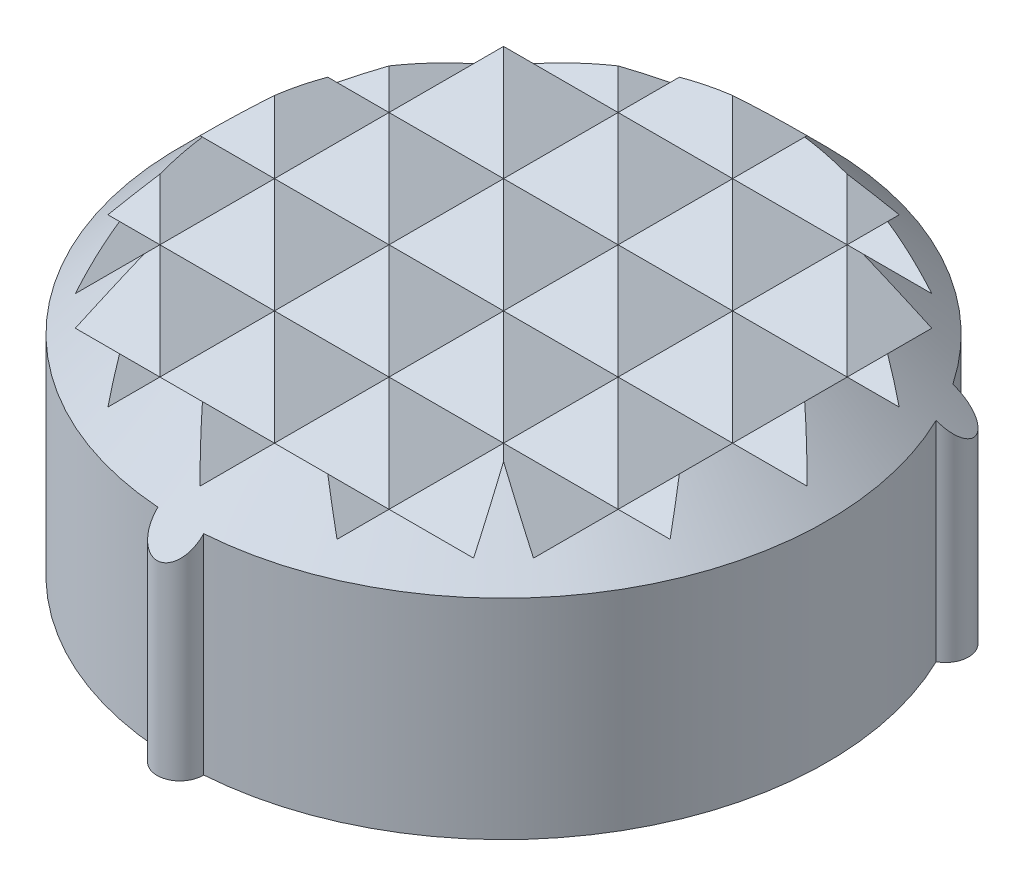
ISO-10303-21;
HEADER;
FILE_DESCRIPTION(('STEP AP214'),'2;1');
FILE_NAME('part.step','',(''),(''),'','','');
FILE_SCHEMA(('AUTOMOTIVE_DESIGN { 1 0 10303 214 1 1 1 1 }'));
ENDSEC;
DATA;
#1=APPLICATION_CONTEXT('core data for automotive mechanical design processes');
#2=APPLICATION_PROTOCOL_DEFINITION('international standard','automotive_design',2000,#1);
#3=PRODUCT_CONTEXT('',#1,'mechanical');
#4=PRODUCT('Part','Part','',(#3));
#5=PRODUCT_RELATED_PRODUCT_CATEGORY('part','',(#4));
#6=PRODUCT_DEFINITION_FORMATION('','',#4);
#7=PRODUCT_DEFINITION_CONTEXT('part definition',#1,'design');
#8=PRODUCT_DEFINITION('design','',#6,#7);
#9=PRODUCT_DEFINITION_SHAPE('','',#8);
#10=(LENGTH_UNIT() NAMED_UNIT(*) SI_UNIT(.MILLI.,.METRE.));
#11=(NAMED_UNIT(*) PLANE_ANGLE_UNIT() SI_UNIT($,.RADIAN.));
#12=(NAMED_UNIT(*) SI_UNIT($,.STERADIAN.) SOLID_ANGLE_UNIT());
#13=UNCERTAINTY_MEASURE_WITH_UNIT(LENGTH_MEASURE(1.E-05),#10,'distance_accuracy_value','');
#14=(GEOMETRIC_REPRESENTATION_CONTEXT(3) GLOBAL_UNCERTAINTY_ASSIGNED_CONTEXT((#13)) GLOBAL_UNIT_ASSIGNED_CONTEXT((#10,
#11,#12)) REPRESENTATION_CONTEXT('',''));
#15=CARTESIAN_POINT('',(0.,0.,0.));
#16=DIRECTION('',(0.,0.,1.));
#17=DIRECTION('',(1.,0.,0.));
#18=AXIS2_PLACEMENT_3D('',#15,#16,#17);
#19=CARTESIAN_POINT('',(0.,1.,0.));
#20=DIRECTION('',(0.,-1.,0.));
#21=DIRECTION('',(0.,0.,-1.));
#22=AXIS2_PLACEMENT_3D('',#19,#20,#21);
#23=CONICAL_SURFACE('',#22,8.30000000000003,0.785398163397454);
#24=CARTESIAN_POINT('',(-0.399742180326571,3.65020000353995,5.6356407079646));
#25=CARTESIAN_POINT('',(-0.400281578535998,3.63502719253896,5.65081283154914));
#26=CARTESIAN_POINT('',(-0.399968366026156,3.61987927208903,5.66602162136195));
#27=CARTESIAN_POINT('',(-0.397588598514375,3.5896908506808,5.6964515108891));
#28=CARTESIAN_POINT('',(-0.395519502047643,3.57465053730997,5.71167259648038));
#29=CARTESIAN_POINT('',(-0.3865573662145,3.52959302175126,5.75745093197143));
#30=CARTESIAN_POINT('',(-0.376898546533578,3.49989716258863,5.78786525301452));
#31=CARTESIAN_POINT('',(-0.353673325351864,3.45104808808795,5.83825900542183));
#32=CARTESIAN_POINT('',(-0.342104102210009,3.43137189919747,5.85866688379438));
#33=CARTESIAN_POINT('',(-0.314743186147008,3.39361875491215,5.89800767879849));
#34=CARTESIAN_POINT('',(-0.298966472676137,3.37553642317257,5.91694552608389));
#35=CARTESIAN_POINT('',(-0.267315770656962,3.3458371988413,5.94817608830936));
#36=CARTESIAN_POINT('',(-0.252402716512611,3.33371865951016,5.96096342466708));
#37=CARTESIAN_POINT('',(-0.219957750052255,3.31128680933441,5.98469561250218));
#38=CARTESIAN_POINT('',(-0.202428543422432,3.30097165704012,5.99564234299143));
#39=CARTESIAN_POINT('',(-0.168542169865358,3.2845003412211,6.01315766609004));
#40=CARTESIAN_POINT('',(-0.152616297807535,3.27792558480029,6.02016360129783));
#41=CARTESIAN_POINT('',(-0.119390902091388,3.26666761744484,6.03217414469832));
#42=CARTESIAN_POINT('',(-0.102092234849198,3.26198323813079,6.03717998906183));
#43=CARTESIAN_POINT('',(-0.0664171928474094,3.25479018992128,6.04487153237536));
#44=CARTESIAN_POINT('',(-0.048034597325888,3.25229572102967,6.04754208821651));
#45=CARTESIAN_POINT('',(-0.0109101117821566,3.24973518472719,6.0502834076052));
#46=CARTESIAN_POINT('',(0.00783160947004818,3.24966800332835,6.05035536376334));
#47=CARTESIAN_POINT('',(0.0430114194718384,3.25184024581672,6.04802970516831));
#48=CARTESIAN_POINT('',(0.0594832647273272,3.25383613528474,6.04589283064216));
#49=CARTESIAN_POINT('',(0.0917237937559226,3.25963768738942,6.03968748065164));
#50=CARTESIAN_POINT('',(0.107492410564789,3.26344352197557,6.0356188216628));
#51=CARTESIAN_POINT('',(0.138454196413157,3.27279326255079,6.02563705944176));
#52=CARTESIAN_POINT('',(0.153615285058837,3.27838650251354,6.01967163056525));
#53=CARTESIAN_POINT('',(0.182613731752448,3.2910008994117,6.0062416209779));
#54=CARTESIAN_POINT('',(0.196450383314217,3.29802281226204,5.99877624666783));
#55=CARTESIAN_POINT('',(0.229023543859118,3.31690910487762,5.97873898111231));
#56=CARTESIAN_POINT('',(0.246907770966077,3.32947632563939,5.96543999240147));
#57=CARTESIAN_POINT('',(0.279496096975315,3.35647785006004,5.9369709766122));
#58=CARTESIAN_POINT('',(0.294193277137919,3.37091610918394,5.92179698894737));
#59=CARTESIAN_POINT('',(0.32521968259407,3.40650643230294,5.88454416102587));
#60=CARTESIAN_POINT('',(0.340264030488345,3.42821746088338,5.86193170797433));
#61=CARTESIAN_POINT('',(0.365164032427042,3.47317330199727,5.81538944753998));
#62=CARTESIAN_POINT('',(0.375008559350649,3.49642128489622,5.79145693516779));
#63=CARTESIAN_POINT('',(0.389109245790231,3.5413830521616,5.74546175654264));
#64=CARTESIAN_POINT('',(0.39383132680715,3.56301294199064,5.72345596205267));
#65=CARTESIAN_POINT('',(0.399519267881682,3.60649040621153,5.67947562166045));
#66=CARTESIAN_POINT('',(0.40051113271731,3.62833540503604,5.65750193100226));
#67=CARTESIAN_POINT('',(0.399742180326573,3.65020000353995,5.6356407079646));
#68=B_SPLINE_CURVE_WITH_KNOTS('',3,(#24,#25,#26,#27,#28,#29,#30,#31,#32,#33,#34,#35,#36,#37,#38,
#39,#40,#41,#42,#43,#44,#45,#46,#47,#48,#49,#50,#51,#52,#53,#54,#55,#56,#57,#58,#59,#60,#61,#62,
#63,#64,#65,#66,#67),.UNSPECIFIED.,.F.,.F.,(4,2,2,2,2,2,2,2,2,2,2,2,2,2,2,2,2,2,2,2,2,4),(0.,
0.0643461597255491,0.128785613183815,0.258746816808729,0.350316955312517,0.441565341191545,
0.510573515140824,0.579510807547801,0.635087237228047,0.690629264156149,0.746528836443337,
0.802402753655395,0.852359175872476,0.902320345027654,0.953800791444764,1.00530854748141,
1.08163954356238,1.15813462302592,1.26188985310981,1.36586621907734,1.45928542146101,
1.55205214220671),.UNSPECIFIED.);
#69=CARTESIAN_POINT('',(-0.399749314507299,3.65000000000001,5.6358407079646));
#70=VERTEX_POINT('',#69);
#71=CARTESIAN_POINT('',(0.3997493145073,3.65000000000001,5.6358407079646));
#72=VERTEX_POINT('',#71);
#73=EDGE_CURVE('E507',#70,#72,#68,.T.);
#74=ORIENTED_EDGE('',*,*,#73,.T.);
#75=CARTESIAN_POINT('',(0.,3.65000000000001,0.));
#76=DIRECTION('',(0.,-1.,0.));
#77=DIRECTION('',(0.,0.,-1.));
#78=AXIS2_PLACEMENT_3D('',#75,#76,#77);
#79=CIRCLE('',#78,5.65);
#80=CARTESIAN_POINT('',(5.0806558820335,3.65000000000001,-2.47172729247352));
#81=VERTEX_POINT('',#80);
#82=EDGE_CURVE('E508',#72,#81,#79,.F.);
#83=ORIENTED_EDGE('',*,*,#82,.T.);
#84=CARTESIAN_POINT('',(5.08027879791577,3.65042658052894,-2.47152729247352));
#85=CARTESIAN_POINT('',(5.09369428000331,3.63525086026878,-2.47863984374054));
#86=CARTESIAN_POINT('',(5.10671529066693,3.62009980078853,-2.4865094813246));
#87=CARTESIAN_POINT('',(5.13189148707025,3.58990468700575,-2.50377397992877));
#88=CARTESIAN_POINT('',(5.14404539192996,3.57486081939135,-2.51317103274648));
#89=CARTESIAN_POINT('',(5.17922974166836,3.52979205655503,-2.54380618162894));
#90=CARTESIAN_POINT('',(5.20075391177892,3.50008785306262,-2.56736889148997));
#91=CARTESIAN_POINT('',(5.23281225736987,3.45121750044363,-2.61267047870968));
#92=CARTESIAN_POINT('',(5.24471496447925,3.43152916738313,-2.63289419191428));
#93=CARTESIAN_POINT('',(5.26513084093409,3.39375142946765,-2.67626376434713));
#94=CARTESIAN_POINT('',(5.27365577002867,3.37565665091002,-2.69939910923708));
#95=CARTESIAN_POINT('',(5.28489705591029,3.34593729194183,-2.74243096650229));
#96=CARTESIAN_POINT('',(5.28852288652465,3.33381087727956,-2.76174172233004));
#97=CARTESIAN_POINT('',(5.29286894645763,3.31136306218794,-2.8017116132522));
#98=CARTESIAN_POINT('',(5.29359215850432,3.30103981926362,-2.8223693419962));
#99=CARTESIAN_POINT('',(5.29183066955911,3.284554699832,-2.8604799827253));
#100=CARTESIAN_POINT('',(5.28994077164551,3.27797406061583,-2.8777776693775));
#101=CARTESIAN_POINT('',(5.28374036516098,3.26670425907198,-2.9125632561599));
#102=CARTESIAN_POINT('',(5.27943135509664,3.26201392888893,-2.93005103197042));
#103=CARTESIAN_POINT('',(5.26826411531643,3.25480920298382,-2.96480125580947));
#104=CARTESIAN_POINT('',(5.26138963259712,3.25230902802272,-2.98206152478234));
#105=CARTESIAN_POINT('',(5.24520800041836,3.24973791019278,-3.01559422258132));
#106=CARTESIAN_POINT('',(5.2359019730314,3.24966584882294,-3.03186710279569));
#107=CARTESIAN_POINT('',(5.21630255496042,3.25182985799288,-3.06118059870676));
#108=CARTESIAN_POINT('',(5.20621851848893,3.25382197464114,-3.07438098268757));
#109=CARTESIAN_POINT('',(5.18472829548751,3.25961656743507,-3.09920729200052));
#110=CARTESIAN_POINT('',(5.1733219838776,3.26341921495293,-3.11083306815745));
#111=CARTESIAN_POINT('',(5.14920100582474,3.27276236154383,-3.13266229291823));
#112=CARTESIAN_POINT('',(5.13645720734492,3.2783519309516,-3.14281210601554));
#113=CARTESIAN_POINT('',(5.11033262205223,3.29095922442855,-3.16121615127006));
#114=CARTESIAN_POINT('',(5.09695150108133,3.29797770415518,-3.16946937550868));
#115=CARTESIAN_POINT('',(5.06332033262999,3.31685422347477,-3.1876661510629));
#116=CARTESIAN_POINT('',(5.04286655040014,3.32941490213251,-3.19650875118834));
#117=CARTESIAN_POINT('',(5.0019277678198,3.35640344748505,-3.21050549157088));
#118=CARTESIAN_POINT('',(4.98144279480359,3.37083526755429,-3.21565166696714));
#119=CARTESIAN_POINT('',(4.93367768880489,3.40641064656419,-3.22390778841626));
#120=CARTESIAN_POINT('',(4.90657749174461,3.42811325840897,-3.22563856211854));
#121=CARTESIAN_POINT('',(4.85382889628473,3.47305284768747,-3.22394914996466));
#122=CARTESIAN_POINT('',(4.82818372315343,3.49629300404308,-3.22051795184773));
#123=CARTESIAN_POINT('',(4.78126974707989,3.54127432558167,-3.20974282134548));
#124=CARTESIAN_POINT('',(4.75981983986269,3.56293265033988,-3.20282496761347));
#125=CARTESIAN_POINT('',(4.71883017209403,3.60646781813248,-3.1857429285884));
#126=CARTESIAN_POINT('',(4.69927810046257,3.62834207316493,-3.1756017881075));
#127=CARTESIAN_POINT('',(4.6807065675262,3.65023580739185,-3.16398822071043));
#128=B_SPLINE_CURVE_WITH_KNOTS('',3,(#84,#85,#86,#87,#88,#89,#90,#91,#92,#93,#94,#95,#96,#97,
#98,#99,#100,#101,#102,#103,#104,#105,#106,#107,#108,#109,#110,#111,#112,#113,#114,#115,#116,
#117,#118,#119,#120,#121,#122,#123,#124,#125,#126,#127),.UNSPECIFIED.,.F.,.F.,(4,2,2,2,2,2,2,2,
2,2,2,2,2,2,2,2,2,2,2,2,2,4),(0.,0.0643578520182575,0.128808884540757,0.25879295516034,
0.350403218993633,0.441691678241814,0.510721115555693,0.57967960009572,0.635267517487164,
0.690821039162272,0.746732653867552,0.802618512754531,0.852577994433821,0.902542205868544,
0.954017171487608,1.00551942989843,1.08183152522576,1.15830756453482,1.26203682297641,
1.36598768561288,1.45953231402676,1.55242264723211),.UNSPECIFIED.);
#129=CARTESIAN_POINT('',(4.6809065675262,3.65000000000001,-3.164113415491));
#130=VERTEX_POINT('',#129);
#131=EDGE_CURVE('E659',#81,#130,#128,.T.);
#132=ORIENTED_EDGE('',*,*,#131,.T.);
#133=CARTESIAN_POINT('',(0.,3.65000000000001,0.));
#134=DIRECTION('',(0.,-1.,0.));
#135=DIRECTION('',(0.,0.,-1.));
#136=AXIS2_PLACEMENT_3D('',#133,#134,#135);
#137=CIRCLE('',#136,5.65);
#138=CARTESIAN_POINT('',(-4.68090656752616,3.65000000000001,-3.16411341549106));
#139=VERTEX_POINT('',#138);
#140=EDGE_CURVE('E707',#130,#139,#137,.F.);
#141=ORIENTED_EDGE('',*,*,#140,.T.);
#142=CARTESIAN_POINT('',(-4.68070656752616,3.65023580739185,-3.1639882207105));
#143=CARTESIAN_POINT('',(-4.69357594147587,3.6350625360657,-3.17204278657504));
#144=CARTESIAN_POINT('',(-4.70690343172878,3.6199141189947,-3.17937728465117));
#145=CARTESIAN_POINT('',(-4.73444584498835,3.58972463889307,-3.19253397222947));
#146=CARTESIAN_POINT('',(-4.74866202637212,3.57468376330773,-3.1983539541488));
#147=CARTESIAN_POINT('',(-4.79278777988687,3.52962446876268,-3.21348567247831));
#148=CARTESIAN_POINT('',(-4.82395660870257,3.49992728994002,-3.22033069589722));
#149=CARTESIAN_POINT('',(-4.87921253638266,3.45107485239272,-3.22541857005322));
#150=CARTESIAN_POINT('',(-4.90267203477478,3.43139674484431,-3.22560508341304));
#151=CARTESIAN_POINT('',(-4.95042522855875,3.39363971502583,-3.22158350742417));
#152=CARTESIAN_POINT('',(-4.97471570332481,3.37555541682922,-3.2173908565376));
#153=CARTESIAN_POINT('',(-5.01758996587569,3.34585301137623,-3.20559809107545));
#154=CARTESIAN_POINT('',(-5.03612157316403,3.33373322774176,-3.19907763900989));
#155=CARTESIAN_POINT('',(-5.07289875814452,3.31129885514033,-3.18284729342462));
#156=CARTESIAN_POINT('',(-5.09114461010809,3.30098242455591,-3.17314068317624));
#157=CARTESIAN_POINT('',(-5.12325842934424,3.28450892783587,-3.1525531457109));
#158=CARTESIAN_POINT('',(-5.13728947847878,3.27793324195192,-3.1422644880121));
#159=CARTESIAN_POINT('',(-5.1643053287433,3.26667340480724,-3.11949671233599));
#160=CARTESIAN_POINT('',(-5.17729077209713,3.2619880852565,-3.10701895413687));
#161=CARTESIAN_POINT('',(-5.20179131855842,3.25479319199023,-3.07996978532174));
#162=CARTESIAN_POINT('',(-5.21329641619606,3.25229782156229,-3.06538541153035));
#163=CARTESIAN_POINT('',(-5.23423477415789,3.2497356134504,-3.03460532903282));
#164=CARTESIAN_POINT('',(-5.24366898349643,3.24966766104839,-3.01841036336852));
#165=CARTESIAN_POINT('',(-5.25924649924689,3.25183860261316,-2.98678078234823));
#166=CARTESIAN_POINT('',(-5.26563254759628,3.25383389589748,-2.97144734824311));
#167=CARTESIAN_POINT('',(-5.27638021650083,3.25963434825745,-2.94042348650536));
#168=CARTESIAN_POINT('',(-5.2807416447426,3.26343967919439,-2.92473302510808));
#169=CARTESIAN_POINT('',(-5.28757930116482,3.27278837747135,-2.89292854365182));
#170=CARTESIAN_POINT('',(-5.28999422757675,3.27838103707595,-2.87681613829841));
#171=CARTESIAN_POINT('',(-5.29286392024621,3.29099431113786,-2.84498802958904));
#172=CARTESIAN_POINT('',(-5.29331764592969,3.2980156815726,-2.82927254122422));
#173=CARTESIAN_POINT('',(-5.2922529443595,3.31690043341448,-2.79104534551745));
#174=CARTESIAN_POINT('',(-5.28967877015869,3.32946662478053,-2.76890810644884));
#175=CARTESIAN_POINT('',(-5.28132007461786,3.3564660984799,-2.72645198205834));
#176=CARTESIAN_POINT('',(-5.27552866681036,3.37090333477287,-2.70613710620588));
#177=CARTESIAN_POINT('',(-5.25878254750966,3.4064912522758,-2.66064144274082));
#178=CARTESIAN_POINT('',(-5.24672330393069,3.42820090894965,-2.63630649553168));
#179=CARTESIAN_POINT('',(-5.21886961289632,3.47315416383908,-2.59147105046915));
#180=CARTESIAN_POINT('',(-5.20306724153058,3.49640093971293,-2.57097885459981));
#181=CARTESIAN_POINT('',(-5.170257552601,3.54140162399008,-2.53573658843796));
#182=CARTESIAN_POINT('',(-5.15352788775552,3.56307297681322,-2.52061755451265));
#183=CARTESIAN_POINT('',(-5.11821098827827,3.60663377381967,-2.49366049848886));
#184=CARTESIAN_POINT('',(-5.09963756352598,3.62852063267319,-2.4818002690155));
#185=CARTESIAN_POINT('',(-5.08027879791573,3.65042658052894,-2.47152729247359));
#186=B_SPLINE_CURVE_WITH_KNOTS('',3,(#142,#143,#144,#145,#146,#147,#148,#149,#150,#151,#152,
#153,#154,#155,#156,#157,#158,#159,#160,#161,#162,#163,#164,#165,#166,#167,#168,#169,#170,#171,
#172,#173,#174,#175,#176,#177,#178,#179,#180,#181,#182,#183,#184,#185),.UNSPECIFIED.,.F.,.F.,(4,
2,2,2,2,2,2,2,2,2,2,2,2,2,2,2,2,2,2,2,2,4),(0.,0.0643480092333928,0.128789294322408,
0.258754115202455,0.350330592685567,0.441585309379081,0.510596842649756,0.579537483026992,
0.635115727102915,0.690659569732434,0.746561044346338,0.802436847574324,0.852393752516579,
0.902355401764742,0.953834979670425,1.00534186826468,1.08166990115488,1.15816194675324,
1.26191286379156,1.36588540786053,1.45948132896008,1.55242265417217),.UNSPECIFIED.);
#187=CARTESIAN_POINT('',(-5.08065588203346,3.65000000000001,-2.47172729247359));
#188=VERTEX_POINT('',#187);
#189=EDGE_CURVE('E661',#139,#188,#186,.T.);
#190=ORIENTED_EDGE('',*,*,#189,.T.);
#191=CARTESIAN_POINT('',(0.,3.65000000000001,0.));
#192=DIRECTION('',(0.,-1.,0.));
#193=DIRECTION('',(0.,0.,-1.));
#194=AXIS2_PLACEMENT_3D('',#191,#192,#193);
#195=CIRCLE('',#194,5.65);
#196=EDGE_CURVE('E505',#188,#70,#195,.F.);
#197=ORIENTED_EDGE('',*,*,#196,.T.);
#198=EDGE_LOOP('',(#74,#83,#132,#141,#190,#197));
#199=FACE_BOUND('',#198,.T.);
#200=CARTESIAN_POINT('',(0.9998,5.0002,4.18194691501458));
#201=CARTESIAN_POINT('',(1.08166603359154,4.91833396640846,4.2465406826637));
#202=CARTESIAN_POINT('',(1.16397524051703,4.83602475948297,4.31000202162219));
#203=CARTESIAN_POINT('',(1.32935847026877,4.67064152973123,4.43482530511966));
#204=CARTESIAN_POINT('',(1.41243228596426,4.58756771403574,4.49618779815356));
#205=CARTESIAN_POINT('',(1.57926080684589,4.42073919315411,4.61700861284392));
#206=CARTESIAN_POINT('',(1.66301546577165,4.33698453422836,4.67646706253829));
#207=CARTESIAN_POINT('',(1.83115747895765,4.16884252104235,4.79364818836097));
#208=CARTESIAN_POINT('',(1.91554499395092,4.08445500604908,4.85137040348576));
#209=CARTESIAN_POINT('',(2.0002,3.9998,4.90829094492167));
#210=B_SPLINE_CURVE_WITH_KNOTS('',3,(#200,#201,#202,#203,#204,#205,#206,#207,#208,#209),
.UNSPECIFIED.,.F.,.F.,(4,2,2,2,4),(0.,0.397715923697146,0.795327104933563,1.19291149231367,
1.59060053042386),.UNSPECIFIED.);
#211=CARTESIAN_POINT('',(1.46546108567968,4.53453891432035,4.53453891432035));
#212=VERTEX_POINT('',#211);
#213=CARTESIAN_POINT('',(2.,4.,4.90815647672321));
#214=VERTEX_POINT('',#213);
#215=EDGE_CURVE('E491',#212,#214,#210,.T.);
#216=ORIENTED_EDGE('',*,*,#215,.F.);
#217=CARTESIAN_POINT('',(3.47760262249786,3.99979999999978,3.99979999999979));
#218=CARTESIAN_POINT('',(3.2680140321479,4.07820263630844,4.07820263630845));
#219=CARTESIAN_POINT('',(3.05407954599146,4.15108606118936,4.15108606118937));
#220=CARTESIAN_POINT('',(2.61791818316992,4.28408709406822,4.28408709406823));
#221=CARTESIAN_POINT('',(2.39567495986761,4.34417779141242,4.34417779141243));
#222=CARTESIAN_POINT('',(1.94540656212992,4.44923653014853,4.44923653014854));
#223=CARTESIAN_POINT('',(1.71741951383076,4.49428522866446,4.49428522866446));
#224=CARTESIAN_POINT('',(1.25634855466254,4.56799174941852,4.56799174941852));
#225=CARTESIAN_POINT('',(1.02326901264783,4.59666308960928,4.59666308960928));
#226=CARTESIAN_POINT('',(0.570556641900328,4.63505702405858,4.63505702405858));
#227=CARTESIAN_POINT('',(0.351125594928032,4.64596628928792,4.64596628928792));
#228=CARTESIAN_POINT('',(-0.0882292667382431,4.65217579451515,4.65217579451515));
#229=CARTESIAN_POINT('',(-0.308153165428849,4.64747313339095,4.64747313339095));
#230=CARTESIAN_POINT('',(-0.746189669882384,4.62264410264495,4.62264410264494));
#231=CARTESIAN_POINT('',(-0.964302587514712,4.60252044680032,4.60252044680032));
#232=CARTESIAN_POINT('',(-1.39674891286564,4.54762567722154,4.54762567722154));
#233=CARTESIAN_POINT('',(-1.6110830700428,4.51285750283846,4.51285750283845));
#234=CARTESIAN_POINT('',(-1.96643483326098,4.44321630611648,4.44321630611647));
#235=CARTESIAN_POINT('',(-2.10890238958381,4.41195929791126,4.41195929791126));
#236=CARTESIAN_POINT('',(-2.39109933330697,4.34368544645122,4.34368544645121));
#237=CARTESIAN_POINT('',(-2.53082791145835,4.30666692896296,4.30666692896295));
#238=CARTESIAN_POINT('',(-2.80696842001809,4.22741722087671,4.2274172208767));
#239=CARTESIAN_POINT('',(-2.94338617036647,4.18519611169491,4.1851961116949));
#240=CARTESIAN_POINT('',(-3.21295433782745,4.09597247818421,4.09597247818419));
#241=CARTESIAN_POINT('',(-3.34610682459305,4.04897308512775,4.04897308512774));
#242=CARTESIAN_POINT('',(-3.47760262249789,3.99979999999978,3.99979999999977));
#243=B_SPLINE_CURVE_WITH_KNOTS('',3,(#217,#218,#219,#220,#221,#222,#223,#224,#225,#226,#227,
#228,#229,#230,#231,#232,#233,#234,#235,#236,#237,#238,#239,#240,#241,#242),.UNSPECIFIED.,.F.,
.F.,(4,2,2,2,2,2,2,2,2,2,2,2,4),(0.,0.711453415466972,1.42438896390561,2.13343785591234,
2.84190064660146,3.5007355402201,4.15969287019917,4.81853426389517,5.47724348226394,
5.92451260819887,6.37191194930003,6.81845757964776,7.26471244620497),.UNSPECIFIED.);
#244=CARTESIAN_POINT('',(0.628746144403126,4.62874614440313,4.62874614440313));
#245=VERTEX_POINT('',#244);
#246=EDGE_CURVE('E357',#212,#245,#243,.T.);
#247=ORIENTED_EDGE('',*,*,#246,.T.);
#248=CARTESIAN_POINT('',(-0.000199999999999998,3.9998,5.30019999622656));
#249=CARTESIAN_POINT('',(0.0866341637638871,4.08663416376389,5.21335778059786));
#250=CARTESIAN_POINT('',(0.17277028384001,4.17277028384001,5.12510199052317));
#251=CARTESIAN_POINT('',(0.343342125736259,4.34334212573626,4.94556913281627));
#252=CARTESIAN_POINT('',(0.427779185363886,4.42777918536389,4.85429460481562));
#253=CARTESIAN_POINT('',(0.594810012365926,4.59481001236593,4.66836831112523));
#254=CARTESIAN_POINT('',(0.677403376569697,4.6774033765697,4.57371581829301));
#255=CARTESIAN_POINT('',(0.840481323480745,4.84048132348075,4.38065988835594));
#256=CARTESIAN_POINT('',(0.920964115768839,4.92096411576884,4.28225343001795));
#257=CARTESIAN_POINT('',(1.0002,5.0002,4.18185126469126));
#258=B_SPLINE_CURVE_WITH_KNOTS('',3,(#248,#249,#250,#251,#252,#253,#254,#255,#256,#257),
.UNSPECIFIED.,.F.,.F.,(4,2,2,2,4),(0.,0.451222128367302,0.902073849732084,1.35302321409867,
1.80434349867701),.UNSPECIFIED.);
#259=CARTESIAN_POINT('',(0.,4.,5.3));
#260=VERTEX_POINT('',#259);
#261=EDGE_CURVE('E614',#260,#245,#258,.T.);
#262=ORIENTED_EDGE('',*,*,#261,.F.);
#263=CARTESIAN_POINT('',(-1.0002,5.0002,4.18185126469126));
#264=CARTESIAN_POINT('',(-0.920964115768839,4.92096411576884,4.28225343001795));
#265=CARTESIAN_POINT('',(-0.840481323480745,4.84048132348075,4.38065988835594));
#266=CARTESIAN_POINT('',(-0.677403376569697,4.6774033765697,4.57371581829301));
#267=CARTESIAN_POINT('',(-0.594810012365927,4.59481001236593,4.66836831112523));
#268=CARTESIAN_POINT('',(-0.427779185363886,4.42777918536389,4.85429460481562));
#269=CARTESIAN_POINT('',(-0.343342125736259,4.34334212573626,4.94556913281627));
#270=CARTESIAN_POINT('',(-0.17277028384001,4.17277028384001,5.12510199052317));
#271=CARTESIAN_POINT('',(-0.086634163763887,4.08663416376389,5.21335778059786));
#272=CARTESIAN_POINT('',(0.000199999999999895,3.9998,5.30019999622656));
#273=B_SPLINE_CURVE_WITH_KNOTS('',3,(#263,#264,#265,#266,#267,#268,#269,#270,#271,#272),
.UNSPECIFIED.,.F.,.F.,(4,2,2,2,4),(0.,0.451320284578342,0.902269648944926,1.35312137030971,
1.80434349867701),.UNSPECIFIED.);
#274=CARTESIAN_POINT('',(-0.628746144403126,4.62874614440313,4.62874614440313));
#275=VERTEX_POINT('',#274);
#276=EDGE_CURVE('E429',#275,#260,#273,.T.);
#277=ORIENTED_EDGE('',*,*,#276,.F.);
#278=CARTESIAN_POINT('',(-1.46546108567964,4.53453891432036,4.53453891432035));
#279=VERTEX_POINT('',#278);
#280=EDGE_CURVE('E792',#275,#279,#243,.T.);
#281=ORIENTED_EDGE('',*,*,#280,.T.);
#282=CARTESIAN_POINT('',(-2.0002,3.9998,4.90829094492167));
#283=CARTESIAN_POINT('',(-1.91554499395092,4.08445500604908,4.85137040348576));
#284=CARTESIAN_POINT('',(-1.83115747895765,4.16884252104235,4.79364818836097));
#285=CARTESIAN_POINT('',(-1.66301546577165,4.33698453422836,4.67646706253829));
#286=CARTESIAN_POINT('',(-1.57926080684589,4.42073919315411,4.61700861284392));
#287=CARTESIAN_POINT('',(-1.41243228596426,4.58756771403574,4.49618779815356));
#288=CARTESIAN_POINT('',(-1.32935847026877,4.67064152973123,4.43482530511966));
#289=CARTESIAN_POINT('',(-1.16397524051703,4.83602475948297,4.31000202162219));
#290=CARTESIAN_POINT('',(-1.08166603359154,4.91833396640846,4.2465406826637));
#291=CARTESIAN_POINT('',(-0.9998,5.0002,4.18194691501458));
#292=B_SPLINE_CURVE_WITH_KNOTS('',3,(#282,#283,#284,#285,#286,#287,#288,#289,#290,#291),
.UNSPECIFIED.,.F.,.F.,(4,2,2,2,4),(0.,0.397689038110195,0.795273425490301,1.19288460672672,
1.59060053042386),.UNSPECIFIED.);
#293=CARTESIAN_POINT('',(-2.,4.,4.90815647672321));
#294=VERTEX_POINT('',#293);
#295=EDGE_CURVE('E753',#294,#279,#292,.T.);
#296=ORIENTED_EDGE('',*,*,#295,.F.);
#297=CARTESIAN_POINT('',(-3.0002,5.0002,3.08011038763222));
#298=CARTESIAN_POINT('',(-2.93007702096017,4.93007702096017,3.24625138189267));
#299=CARTESIAN_POINT('',(-2.85584389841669,4.85584389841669,3.40879974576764));
#300=CARTESIAN_POINT('',(-2.70056026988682,4.70056026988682,3.72653472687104));
#301=CARTESIAN_POINT('',(-2.6195312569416,4.6195312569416,3.88174229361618));
#302=CARTESIAN_POINT('',(-2.45168713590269,4.45168713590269,4.18550153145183));
#303=CARTESIAN_POINT('',(-2.3648769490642,4.3648769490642,4.33405868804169));
#304=CARTESIAN_POINT('',(-2.18600888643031,4.18600888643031,4.62552462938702));
#305=CARTESIAN_POINT('',(-2.09393578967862,4.09393578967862,4.76841477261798));
#306=CARTESIAN_POINT('',(-1.9998,3.9998,4.90845393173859));
#307=B_SPLINE_CURVE_WITH_KNOTS('',3,(#297,#298,#299,#300,#301,#302,#303,#304,#305,#306),
.UNSPECIFIED.,.F.,.F.,(4,2,2,2,4),(0.,0.580189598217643,1.15860886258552,1.73654188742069,
2.31624043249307),.UNSPECIFIED.);
#308=CARTESIAN_POINT('',(-2.35246754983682,4.35246754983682,4.35246754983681));
#309=VERTEX_POINT('',#308);
#310=EDGE_CURVE('E497',#309,#294,#307,.T.);
#311=ORIENTED_EDGE('',*,*,#310,.F.);
#312=CARTESIAN_POINT('',(-3.47706773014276,4.,3.99999999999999));
#313=VERTEX_POINT('',#312);
#314=EDGE_CURVE('E358',#309,#313,#243,.T.);
#315=ORIENTED_EDGE('',*,*,#314,.T.);
#316=CARTESIAN_POINT('',(-3.47714250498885,3.9998,4.00019999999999));
#317=CARTESIAN_POINT('',(-3.4458442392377,4.08351023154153,3.91648976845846));
#318=CARTESIAN_POINT('',(-3.41415369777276,4.16714750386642,3.83285249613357));
#319=CARTESIAN_POINT('',(-3.34992183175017,4.33425293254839,3.6657470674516));
#320=CARTESIAN_POINT('',(-3.31738055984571,4.41772109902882,3.58227890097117));
#321=CARTESIAN_POINT('',(-3.25137664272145,4.58447674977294,3.41552325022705));
#322=CARTESIAN_POINT('',(-3.21791398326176,4.66776423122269,3.3322357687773));
#323=CARTESIAN_POINT('',(-3.1499822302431,4.83413920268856,3.16586079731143));
#324=CARTESIAN_POINT('',(-3.11551307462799,4.91722668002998,3.08277331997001));
#325=CARTESIAN_POINT('',(-3.08049995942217,5.0002,2.99979999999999));
#326=B_SPLINE_CURVE_WITH_KNOTS('',3,(#316,#317,#318,#319,#320,#321,#322,#323,#324,#325),
.UNSPECIFIED.,.F.,.F.,(4,2,2,2,4),(0.,0.367354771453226,0.734686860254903,1.10202462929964,
1.46938509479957),.UNSPECIFIED.);
#327=CARTESIAN_POINT('',(-3.13847763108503,4.86152236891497,3.13847763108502));
#328=VERTEX_POINT('',#327);
#329=EDGE_CURVE('E405',#313,#328,#326,.T.);
#330=ORIENTED_EDGE('',*,*,#329,.T.);
#331=CARTESIAN_POINT('',(-4.0002,3.9998,3.47714250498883));
#332=CARTESIAN_POINT('',(-3.91648976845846,4.08351023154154,3.44584423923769));
#333=CARTESIAN_POINT('',(-3.83285249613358,4.16714750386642,3.41415369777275));
#334=CARTESIAN_POINT('',(-3.66574706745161,4.33425293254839,3.34992183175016));
#335=CARTESIAN_POINT('',(-3.58227890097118,4.41772109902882,3.3173805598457));
#336=CARTESIAN_POINT('',(-3.41552325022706,4.58447674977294,3.25137664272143));
#337=CARTESIAN_POINT('',(-3.33223576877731,4.66776423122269,3.21791398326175));
#338=CARTESIAN_POINT('',(-3.16586079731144,4.83413920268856,3.14998223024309));
#339=CARTESIAN_POINT('',(-3.08277331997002,4.91722668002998,3.11551307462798));
#340=CARTESIAN_POINT('',(-2.9998,5.0002,3.08049995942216));
#341=B_SPLINE_CURVE_WITH_KNOTS('',3,(#331,#332,#333,#334,#335,#336,#337,#338,#339,#340),
.UNSPECIFIED.,.F.,.F.,(4,2,2,2,4),(0.,0.367354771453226,0.734686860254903,1.10202462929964,
1.46938509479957),.UNSPECIFIED.);
#342=CARTESIAN_POINT('',(-4.,4.,3.47706773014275));
#343=VERTEX_POINT('',#342);
#344=EDGE_CURVE('E655',#343,#328,#341,.T.);
#345=ORIENTED_EDGE('',*,*,#344,.F.);
#346=CARTESIAN_POINT('',(-3.9998,3.9998,-3.47760262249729));
#347=CARTESIAN_POINT('',(-4.07820263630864,4.07820263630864,-3.26801403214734));
#348=CARTESIAN_POINT('',(-4.15108606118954,4.15108606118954,-3.05407954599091));
#349=CARTESIAN_POINT('',(-4.28408709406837,4.28408709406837,-2.61791818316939));
#350=CARTESIAN_POINT('',(-4.34417779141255,4.34417779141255,-2.3956749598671));
#351=CARTESIAN_POINT('',(-4.44923653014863,4.44923653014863,-1.94540656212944));
#352=CARTESIAN_POINT('',(-4.49428522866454,4.49428522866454,-1.7174195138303));
#353=CARTESIAN_POINT('',(-4.56799174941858,4.56799174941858,-1.25634855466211));
#354=CARTESIAN_POINT('',(-4.59666308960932,4.59666308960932,-1.02326901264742));
#355=CARTESIAN_POINT('',(-4.6350570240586,4.6350570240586,-0.570556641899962));
#356=CARTESIAN_POINT('',(-4.64596628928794,4.64596628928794,-0.351125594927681));
#357=CARTESIAN_POINT('',(-4.65217579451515,4.65217579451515,0.0882292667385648));
#358=CARTESIAN_POINT('',(-4.64747313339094,4.64747313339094,0.308153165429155));
#359=CARTESIAN_POINT('',(-4.62264410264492,4.62264410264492,0.746189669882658));
#360=CARTESIAN_POINT('',(-4.60252044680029,4.60252044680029,0.96430258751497));
#361=CARTESIAN_POINT('',(-4.5476256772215,4.5476256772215,1.39674891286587));
#362=CARTESIAN_POINT('',(-4.51285750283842,4.51285750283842,1.61108307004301));
#363=CARTESIAN_POINT('',(-4.44321630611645,4.44321630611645,1.96643483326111));
#364=CARTESIAN_POINT('',(-4.41195929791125,4.41195929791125,2.10890238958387));
#365=CARTESIAN_POINT('',(-4.34368544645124,4.34368544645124,2.39109933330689));
#366=CARTESIAN_POINT('',(-4.30666692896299,4.30666692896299,2.5308279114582));
#367=CARTESIAN_POINT('',(-4.22741722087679,4.22741722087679,2.80696842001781));
#368=CARTESIAN_POINT('',(-4.18519611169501,4.18519611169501,2.94338617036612));
#369=CARTESIAN_POINT('',(-4.09597247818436,4.09597247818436,3.21295433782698));
#370=CARTESIAN_POINT('',(-4.04897308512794,4.04897308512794,3.34610682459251));
#371=CARTESIAN_POINT('',(-3.9998,3.9998,3.47760262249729));
#372=B_SPLINE_CURVE_WITH_KNOTS('',3,(#346,#347,#348,#349,#350,#351,#352,#353,#354,#355,#356,
#357,#358,#359,#360,#361,#362,#363,#364,#365,#366,#367,#368,#369,#370,#371),.UNSPECIFIED.,.F.,
.F.,(4,2,2,2,2,2,2,2,2,2,2,2,4),(0.,0.711453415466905,1.42438896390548,2.13343785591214,
2.8419006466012,3.50073554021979,4.15969287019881,4.81853426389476,5.47724348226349,
5.9245126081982,6.37191194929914,6.81845757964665,7.26471244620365),.UNSPECIFIED.);
#373=CARTESIAN_POINT('',(-4.35246754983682,4.35246754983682,2.3524675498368));
#374=VERTEX_POINT('',#373);
#375=EDGE_CURVE('E552',#374,#343,#372,.T.);
#376=ORIENTED_EDGE('',*,*,#375,.F.);
#377=CARTESIAN_POINT('',(-3.08011038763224,5.0002,3.00019999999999));
#378=CARTESIAN_POINT('',(-3.24625138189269,4.93007702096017,2.93007702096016));
#379=CARTESIAN_POINT('',(-3.40879974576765,4.85584389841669,2.85584389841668));
#380=CARTESIAN_POINT('',(-3.72653472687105,4.70056026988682,2.70056026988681));
#381=CARTESIAN_POINT('',(-3.88174229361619,4.6195312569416,2.61953125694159));
#382=CARTESIAN_POINT('',(-4.18550153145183,4.45168713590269,2.45168713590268));
#383=CARTESIAN_POINT('',(-4.33405868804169,4.3648769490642,2.36487694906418));
#384=CARTESIAN_POINT('',(-4.62552462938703,4.18600888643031,2.1860088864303));
#385=CARTESIAN_POINT('',(-4.76841477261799,4.09393578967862,2.0939357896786));
#386=CARTESIAN_POINT('',(-4.9084539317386,3.9998,1.99979999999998));
#387=B_SPLINE_CURVE_WITH_KNOTS('',3,(#377,#378,#379,#380,#381,#382,#383,#384,#385,#386),
.UNSPECIFIED.,.F.,.F.,(4,2,2,2,4),(0.,0.580189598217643,1.15860886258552,1.73654188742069,
2.31624043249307),.UNSPECIFIED.);
#388=CARTESIAN_POINT('',(-4.90815647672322,4.,1.99999999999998));
#389=VERTEX_POINT('',#388);
#390=EDGE_CURVE('E499',#374,#389,#387,.T.);
#391=ORIENTED_EDGE('',*,*,#390,.T.);
#392=CARTESIAN_POINT('',(-4.90829094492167,3.9998,2.00019999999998));
#393=CARTESIAN_POINT('',(-4.85137040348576,4.08445500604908,1.91554499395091));
#394=CARTESIAN_POINT('',(-4.79364818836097,4.16884252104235,1.83115747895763));
#395=CARTESIAN_POINT('',(-4.6764670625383,4.33698453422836,1.66301546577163));
#396=CARTESIAN_POINT('',(-4.61700861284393,4.42073919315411,1.57926080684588));
#397=CARTESIAN_POINT('',(-4.49618779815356,4.58756771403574,1.41243228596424));
#398=CARTESIAN_POINT('',(-4.43482530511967,4.67064152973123,1.32935847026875));
#399=CARTESIAN_POINT('',(-4.31000202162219,4.83602475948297,1.16397524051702));
#400=CARTESIAN_POINT('',(-4.2465406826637,4.91833396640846,1.08166603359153));
#401=CARTESIAN_POINT('',(-4.18194691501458,5.0002,0.999799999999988));
#402=B_SPLINE_CURVE_WITH_KNOTS('',3,(#392,#393,#394,#395,#396,#397,#398,#399,#400,#401),
.UNSPECIFIED.,.F.,.F.,(4,2,2,2,4),(0.,0.397689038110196,0.7952734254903,1.19288460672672,
1.59060053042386),.UNSPECIFIED.);
#403=CARTESIAN_POINT('',(-4.53453891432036,4.53453891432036,1.46546108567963));
#404=VERTEX_POINT('',#403);
#405=EDGE_CURVE('E544',#389,#404,#402,.T.);
#406=ORIENTED_EDGE('',*,*,#405,.T.);
#407=CARTESIAN_POINT('',(-4.62874614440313,4.62874614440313,0.628746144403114));
#408=VERTEX_POINT('',#407);
#409=EDGE_CURVE('E620',#408,#404,#372,.T.);
#410=ORIENTED_EDGE('',*,*,#409,.F.);
#411=CARTESIAN_POINT('',(-4.18185126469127,5.0002,1.00019999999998));
#412=CARTESIAN_POINT('',(-4.28225343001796,4.92096411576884,0.920964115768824));
#413=CARTESIAN_POINT('',(-4.38065988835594,4.84048132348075,0.84048132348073));
#414=CARTESIAN_POINT('',(-4.57371581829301,4.6774033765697,0.677403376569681));
#415=CARTESIAN_POINT('',(-4.66836831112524,4.59481001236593,0.59481001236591));
#416=CARTESIAN_POINT('',(-4.85429460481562,4.42777918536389,0.42777918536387));
#417=CARTESIAN_POINT('',(-4.94556913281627,4.34334212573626,0.343342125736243));
#418=CARTESIAN_POINT('',(-5.12510199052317,4.17277028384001,0.172770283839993));
#419=CARTESIAN_POINT('',(-5.21335778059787,4.08663416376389,0.0866341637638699));
#420=CARTESIAN_POINT('',(-5.30019999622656,3.9998,-0.000200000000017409));
#421=B_SPLINE_CURVE_WITH_KNOTS('',3,(#411,#412,#413,#414,#415,#416,#417,#418,#419,#420),
.UNSPECIFIED.,.F.,.F.,(4,2,2,2,4),(0.,0.451320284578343,0.902269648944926,1.35312137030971,
1.80434349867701),.UNSPECIFIED.);
#422=CARTESIAN_POINT('',(-5.3,4.,0.));
#423=VERTEX_POINT('',#422);
#424=EDGE_CURVE('E606',#408,#423,#421,.T.);
#425=ORIENTED_EDGE('',*,*,#424,.T.);
#426=CARTESIAN_POINT('',(-5.30019999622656,3.9998,0.000199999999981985));
#427=CARTESIAN_POINT('',(-5.21335778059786,4.08663416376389,-0.0866341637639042));
#428=CARTESIAN_POINT('',(-5.12510199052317,4.17277028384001,-0.172770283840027));
#429=CARTESIAN_POINT('',(-4.94556913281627,4.34334212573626,-0.343342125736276));
#430=CARTESIAN_POINT('',(-4.85429460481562,4.42777918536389,-0.427779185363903));
#431=CARTESIAN_POINT('',(-4.66836831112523,4.59481001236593,-0.594810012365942));
#432=CARTESIAN_POINT('',(-4.57371581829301,4.6774033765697,-0.677403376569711));
#433=CARTESIAN_POINT('',(-4.38065988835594,4.84048132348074,-0.840481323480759));
#434=CARTESIAN_POINT('',(-4.28225343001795,4.92096411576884,-0.920964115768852));
#435=CARTESIAN_POINT('',(-4.18185126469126,5.0002,-1.00020000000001));
#436=B_SPLINE_CURVE_WITH_KNOTS('',3,(#426,#427,#428,#429,#430,#431,#432,#433,#434,#435),
.UNSPECIFIED.,.F.,.F.,(4,2,2,2,4),(0.,0.451222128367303,0.902073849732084,1.35302321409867,
1.80434349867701),.UNSPECIFIED.);
#437=CARTESIAN_POINT('',(-4.62874614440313,4.62874614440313,-0.628746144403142));
#438=VERTEX_POINT('',#437);
#439=EDGE_CURVE('E457',#423,#438,#436,.T.);
#440=ORIENTED_EDGE('',*,*,#439,.T.);
#441=CARTESIAN_POINT('',(-4.53453891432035,4.53453891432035,-1.46546108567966));
#442=VERTEX_POINT('',#441);
#443=EDGE_CURVE('E618',#442,#438,#372,.T.);
#444=ORIENTED_EDGE('',*,*,#443,.F.);
#445=CARTESIAN_POINT('',(-4.18194691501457,5.0002,-0.999800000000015));
#446=CARTESIAN_POINT('',(-4.2465406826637,4.91833396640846,-1.08166603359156));
#447=CARTESIAN_POINT('',(-4.31000202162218,4.83602475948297,-1.16397524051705));
#448=CARTESIAN_POINT('',(-4.43482530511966,4.67064152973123,-1.32935847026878));
#449=CARTESIAN_POINT('',(-4.49618779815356,4.58756771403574,-1.41243228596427));
#450=CARTESIAN_POINT('',(-4.61700861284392,4.42073919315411,-1.57926080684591));
#451=CARTESIAN_POINT('',(-4.67646706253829,4.33698453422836,-1.66301546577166));
#452=CARTESIAN_POINT('',(-4.79364818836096,4.16884252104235,-1.83115747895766));
#453=CARTESIAN_POINT('',(-4.85137040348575,4.08445500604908,-1.91554499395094));
#454=CARTESIAN_POINT('',(-4.90829094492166,3.9998,-2.00020000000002));
#455=B_SPLINE_CURVE_WITH_KNOTS('',3,(#445,#446,#447,#448,#449,#450,#451,#452,#453,#454),
.UNSPECIFIED.,.F.,.F.,(4,2,2,2,4),(0.,0.397715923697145,0.795327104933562,1.19291149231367,
1.59060053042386),.UNSPECIFIED.);
#456=CARTESIAN_POINT('',(-4.90815647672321,4.,-2.00000000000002));
#457=VERTEX_POINT('',#456);
#458=EDGE_CURVE('E452',#442,#457,#455,.T.);
#459=ORIENTED_EDGE('',*,*,#458,.T.);
#460=CARTESIAN_POINT('',(-4.90845393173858,3.9998,-1.99980000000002));
#461=CARTESIAN_POINT('',(-4.76841477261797,4.09393578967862,-2.09393578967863));
#462=CARTESIAN_POINT('',(-4.62552462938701,4.18600888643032,-2.18600888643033));
#463=CARTESIAN_POINT('',(-4.33405868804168,4.3648769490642,-2.36487694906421));
#464=CARTESIAN_POINT('',(-4.18550153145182,4.45168713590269,-2.4516871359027));
#465=CARTESIAN_POINT('',(-3.88174229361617,4.6195312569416,-2.61953125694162));
#466=CARTESIAN_POINT('',(-3.72653472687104,4.70056026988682,-2.70056026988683));
#467=CARTESIAN_POINT('',(-3.40879974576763,4.85584389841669,-2.8558438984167));
#468=CARTESIAN_POINT('',(-3.24625138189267,4.93007702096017,-2.93007702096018));
#469=CARTESIAN_POINT('',(-3.08011038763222,5.0002,-3.00020000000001));
#470=B_SPLINE_CURVE_WITH_KNOTS('',3,(#460,#461,#462,#463,#464,#465,#466,#467,#468,#469),
.UNSPECIFIED.,.F.,.F.,(4,2,2,2,4),(0.,0.579698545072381,1.15763156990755,1.73605083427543,
2.31624043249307),.UNSPECIFIED.);
#471=CARTESIAN_POINT('',(-4.35246754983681,4.35246754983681,-2.35246754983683));
#472=VERTEX_POINT('',#471);
#473=EDGE_CURVE('E475',#457,#472,#470,.T.);
#474=ORIENTED_EDGE('',*,*,#473,.T.);
#475=CARTESIAN_POINT('',(-4.,4.,-3.47706773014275));
#476=VERTEX_POINT('',#475);
#477=EDGE_CURVE('E446',#476,#472,#372,.T.);
#478=ORIENTED_EDGE('',*,*,#477,.F.);
#479=CARTESIAN_POINT('',(-2.9998,5.0002,-3.08049995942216));
#480=CARTESIAN_POINT('',(-3.08277331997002,4.91722668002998,-3.11551307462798));
#481=CARTESIAN_POINT('',(-3.16586079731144,4.83413920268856,-3.14998223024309));
#482=CARTESIAN_POINT('',(-3.33223576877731,4.66776423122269,-3.21791398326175));
#483=CARTESIAN_POINT('',(-3.41552325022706,4.58447674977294,-3.25137664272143));
#484=CARTESIAN_POINT('',(-3.58227890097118,4.41772109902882,-3.3173805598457));
#485=CARTESIAN_POINT('',(-3.66574706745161,4.33425293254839,-3.34992183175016));
#486=CARTESIAN_POINT('',(-3.83285249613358,4.16714750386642,-3.41415369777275));
#487=CARTESIAN_POINT('',(-3.91648976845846,4.08351023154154,-3.44584423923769));
#488=CARTESIAN_POINT('',(-4.0002,3.9998,-3.47714250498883));
#489=B_SPLINE_CURVE_WITH_KNOTS('',3,(#479,#480,#481,#482,#483,#484,#485,#486,#487,#488),
.UNSPECIFIED.,.F.,.F.,(4,2,2,2,4),(0.,0.367360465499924,0.734698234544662,1.10203032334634,
1.46938509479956),.UNSPECIFIED.);
#490=CARTESIAN_POINT('',(-3.13847763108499,4.86152236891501,-3.138477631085));
#491=VERTEX_POINT('',#490);
#492=EDGE_CURVE('E653',#491,#476,#489,.T.);
#493=ORIENTED_EDGE('',*,*,#492,.F.);
#494=CARTESIAN_POINT('',(-3.08049995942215,5.0002,-2.99980000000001));
#495=CARTESIAN_POINT('',(-3.11551307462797,4.91722668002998,-3.08277331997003));
#496=CARTESIAN_POINT('',(-3.14998223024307,4.83413920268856,-3.16586079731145));
#497=CARTESIAN_POINT('',(-3.21791398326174,4.66776423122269,-3.33223576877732));
#498=CARTESIAN_POINT('',(-3.25137664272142,4.58447674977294,-3.41552325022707));
#499=CARTESIAN_POINT('',(-3.31738055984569,4.41772109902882,-3.58227890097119));
#500=CARTESIAN_POINT('',(-3.34992183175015,4.33425293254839,-3.66574706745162));
#501=CARTESIAN_POINT('',(-3.41415369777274,4.16714750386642,-3.83285249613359));
#502=CARTESIAN_POINT('',(-3.44584423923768,4.08351023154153,-3.91648976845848));
#503=CARTESIAN_POINT('',(-3.47714250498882,3.9998,-4.00020000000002));
#504=B_SPLINE_CURVE_WITH_KNOTS('',3,(#494,#495,#496,#497,#498,#499,#500,#501,#502,#503),
.UNSPECIFIED.,.F.,.F.,(4,2,2,2,4),(0.,0.367360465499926,0.734698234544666,1.10203032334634,
1.46938509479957),.UNSPECIFIED.);
#505=CARTESIAN_POINT('',(-3.47706773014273,4.,-4.00000000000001));
#506=VERTEX_POINT('',#505);
#507=EDGE_CURVE('E767',#491,#506,#504,.T.);
#508=ORIENTED_EDGE('',*,*,#507,.T.);
#509=CARTESIAN_POINT('',(-3.47760262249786,3.99979999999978,-3.99979999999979));
#510=CARTESIAN_POINT('',(-3.2680140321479,4.07820263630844,-4.07820263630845));
#511=CARTESIAN_POINT('',(-3.05407954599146,4.15108606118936,-4.15108606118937));
#512=CARTESIAN_POINT('',(-2.61791818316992,4.28408709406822,-4.28408709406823));
#513=CARTESIAN_POINT('',(-2.39567495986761,4.34417779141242,-4.34417779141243));
#514=CARTESIAN_POINT('',(-1.94540656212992,4.44923653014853,-4.44923653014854));
#515=CARTESIAN_POINT('',(-1.71741951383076,4.49428522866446,-4.49428522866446));
#516=CARTESIAN_POINT('',(-1.25634855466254,4.56799174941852,-4.56799174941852));
#517=CARTESIAN_POINT('',(-1.02326901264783,4.59666308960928,-4.59666308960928));
#518=CARTESIAN_POINT('',(-0.570556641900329,4.63505702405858,-4.63505702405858));
#519=CARTESIAN_POINT('',(-0.351125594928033,4.64596628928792,-4.64596628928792));
#520=CARTESIAN_POINT('',(0.0882292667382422,4.65217579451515,-4.65217579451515));
#521=CARTESIAN_POINT('',(0.308153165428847,4.64747313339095,-4.64747313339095));
#522=CARTESIAN_POINT('',(0.746189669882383,4.62264410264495,-4.62264410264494));
#523=CARTESIAN_POINT('',(0.96430258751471,4.60252044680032,-4.60252044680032));
#524=CARTESIAN_POINT('',(1.39674891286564,4.54762567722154,-4.54762567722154));
#525=CARTESIAN_POINT('',(1.6110830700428,4.51285750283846,-4.51285750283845));
#526=CARTESIAN_POINT('',(1.96643483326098,4.44321630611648,-4.44321630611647));
#527=CARTESIAN_POINT('',(2.10890238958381,4.41195929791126,-4.41195929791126));
#528=CARTESIAN_POINT('',(2.39109933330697,4.34368544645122,-4.34368544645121));
#529=CARTESIAN_POINT('',(2.53082791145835,4.30666692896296,-4.30666692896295));
#530=CARTESIAN_POINT('',(2.80696842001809,4.22741722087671,-4.2274172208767));
#531=CARTESIAN_POINT('',(2.94338617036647,4.18519611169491,-4.1851961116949));
#532=CARTESIAN_POINT('',(3.21295433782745,4.09597247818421,-4.09597247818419));
#533=CARTESIAN_POINT('',(3.34610682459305,4.04897308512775,-4.04897308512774));
#534=CARTESIAN_POINT('',(3.47760262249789,3.99979999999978,-3.99979999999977));
#535=B_SPLINE_CURVE_WITH_KNOTS('',3,(#509,#510,#511,#512,#513,#514,#515,#516,#517,#518,#519,
#520,#521,#522,#523,#524,#525,#526,#527,#528,#529,#530,#531,#532,#533,#534),.UNSPECIFIED.,.F.,
.F.,(4,2,2,2,2,2,2,2,2,2,2,2,4),(0.,0.711453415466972,1.42438896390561,2.13343785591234,
2.84190064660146,3.50073554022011,4.15969287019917,4.81853426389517,5.47724348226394,
5.92451260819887,6.37191194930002,6.81845757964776,7.26471244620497),.UNSPECIFIED.);
#536=CARTESIAN_POINT('',(-2.35246754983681,4.35246754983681,-4.35246754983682));
#537=VERTEX_POINT('',#536);
#538=EDGE_CURVE('E806',#506,#537,#535,.T.);
#539=ORIENTED_EDGE('',*,*,#538,.T.);
#540=CARTESIAN_POINT('',(-1.99979999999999,3.99979999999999,-4.90845393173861));
#541=CARTESIAN_POINT('',(-2.0939357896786,4.0939357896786,-4.768414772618));
#542=CARTESIAN_POINT('',(-2.1860088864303,4.1860088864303,-4.62552462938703));
#543=CARTESIAN_POINT('',(-2.36487694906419,4.36487694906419,-4.3340586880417));
#544=CARTESIAN_POINT('',(-2.45168713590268,4.45168713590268,-4.18550153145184));
#545=CARTESIAN_POINT('',(-2.6195312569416,4.6195312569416,-3.88174229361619));
#546=CARTESIAN_POINT('',(-2.70056026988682,4.70056026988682,-3.72653472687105));
#547=CARTESIAN_POINT('',(-2.85584389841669,4.85584389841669,-3.40879974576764));
#548=CARTESIAN_POINT('',(-2.93007702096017,4.93007702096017,-3.24625138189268));
#549=CARTESIAN_POINT('',(-3.0002,5.0002,-3.08011038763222));
#550=B_SPLINE_CURVE_WITH_KNOTS('',3,(#540,#541,#542,#543,#544,#545,#546,#547,#548,#549),
.UNSPECIFIED.,.F.,.F.,(4,2,2,2,4),(0.,0.579698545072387,1.15763156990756,1.73605083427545,
2.3162404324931),.UNSPECIFIED.);
#551=CARTESIAN_POINT('',(-2.,4.,-4.90815647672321));
#552=VERTEX_POINT('',#551);
#553=EDGE_CURVE('E493',#552,#537,#550,.T.);
#554=ORIENTED_EDGE('',*,*,#553,.F.);
#555=CARTESIAN_POINT('',(-0.9998,5.0002,-4.18194691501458));
#556=CARTESIAN_POINT('',(-1.08166603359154,4.91833396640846,-4.2465406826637));
#557=CARTESIAN_POINT('',(-1.16397524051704,4.83602475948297,-4.31000202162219));
#558=CARTESIAN_POINT('',(-1.32935847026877,4.67064152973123,-4.43482530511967));
#559=CARTESIAN_POINT('',(-1.41243228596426,4.58756771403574,-4.49618779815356));
#560=CARTESIAN_POINT('',(-1.5792608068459,4.4207391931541,-4.61700861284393));
#561=CARTESIAN_POINT('',(-1.66301546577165,4.33698453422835,-4.67646706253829));
#562=CARTESIAN_POINT('',(-1.83115747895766,4.16884252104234,-4.79364818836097));
#563=CARTESIAN_POINT('',(-1.91554499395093,4.08445500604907,-4.85137040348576));
#564=CARTESIAN_POINT('',(-2.00020000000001,3.99979999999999,-4.90829094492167));
#565=B_SPLINE_CURVE_WITH_KNOTS('',3,(#555,#556,#557,#558,#559,#560,#561,#562,#563,#564),
.UNSPECIFIED.,.F.,.F.,(4,2,2,2,4),(0.,0.39771592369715,0.79532710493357,1.19291149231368,
1.59060053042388),.UNSPECIFIED.);
#566=CARTESIAN_POINT('',(-1.46546108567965,4.53453891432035,-4.53453891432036));
#567=VERTEX_POINT('',#566);
#568=EDGE_CURVE('E557',#567,#552,#565,.T.);
#569=ORIENTED_EDGE('',*,*,#568,.F.);
#570=CARTESIAN_POINT('',(-0.628746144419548,4.62874614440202,-4.62874614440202));
#571=VERTEX_POINT('',#570);
#572=EDGE_CURVE('E581',#567,#571,#535,.T.);
#573=ORIENTED_EDGE('',*,*,#572,.T.);
#574=CARTESIAN_POINT('',(0.000199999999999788,3.9998,-5.30019999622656));
#575=CARTESIAN_POINT('',(-0.0866341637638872,4.08663416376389,-5.21335778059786));
#576=CARTESIAN_POINT('',(-0.17277028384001,4.17277028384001,-5.12510199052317));
#577=CARTESIAN_POINT('',(-0.343342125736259,4.34334212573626,-4.94556913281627));
#578=CARTESIAN_POINT('',(-0.427779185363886,4.42777918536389,-4.85429460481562));
#579=CARTESIAN_POINT('',(-0.594810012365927,4.59481001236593,-4.66836831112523));
#580=CARTESIAN_POINT('',(-0.677403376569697,4.6774033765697,-4.57371581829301));
#581=CARTESIAN_POINT('',(-0.840481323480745,4.84048132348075,-4.38065988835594));
#582=CARTESIAN_POINT('',(-0.920964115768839,4.92096411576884,-4.28225343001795));
#583=CARTESIAN_POINT('',(-1.0002,5.0002,-4.18185126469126));
#584=B_SPLINE_CURVE_WITH_KNOTS('',3,(#574,#575,#576,#577,#578,#579,#580,#581,#582,#583),
.UNSPECIFIED.,.F.,.F.,(4,2,2,2,4),(0.,0.451222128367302,0.902073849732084,1.35302321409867,
1.80434349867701),.UNSPECIFIED.);
#585=CARTESIAN_POINT('',(0.,4.,-5.3));
#586=VERTEX_POINT('',#585);
#587=EDGE_CURVE('E432',#586,#571,#584,.T.);
#588=ORIENTED_EDGE('',*,*,#587,.F.);
#589=CARTESIAN_POINT('',(1.0002,5.0002,-4.18185126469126));
#590=CARTESIAN_POINT('',(0.920964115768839,4.92096411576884,-4.28225343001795));
#591=CARTESIAN_POINT('',(0.840481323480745,4.84048132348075,-4.38065988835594));
#592=CARTESIAN_POINT('',(0.677403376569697,4.6774033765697,-4.57371581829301));
#593=CARTESIAN_POINT('',(0.594810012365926,4.59481001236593,-4.66836831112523));
#594=CARTESIAN_POINT('',(0.427779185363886,4.42777918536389,-4.85429460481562));
#595=CARTESIAN_POINT('',(0.343342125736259,4.34334212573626,-4.94556913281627));
#596=CARTESIAN_POINT('',(0.17277028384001,4.17277028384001,-5.12510199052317));
#597=CARTESIAN_POINT('',(0.0866341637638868,4.08663416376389,-5.21335778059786));
#598=CARTESIAN_POINT('',(-0.000200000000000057,3.9998,-5.30019999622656));
#599=B_SPLINE_CURVE_WITH_KNOTS('',3,(#589,#590,#591,#592,#593,#594,#595,#596,#597,#598),
.UNSPECIFIED.,.F.,.F.,(4,2,2,2,4),(0.,0.451320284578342,0.902269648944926,1.35312137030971,
1.80434349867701),.UNSPECIFIED.);
#600=CARTESIAN_POINT('',(0.628746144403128,4.62874614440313,-4.62874614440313));
#601=VERTEX_POINT('',#600);
#602=EDGE_CURVE('E820',#601,#586,#599,.T.);
#603=ORIENTED_EDGE('',*,*,#602,.F.);
#604=CARTESIAN_POINT('',(1.46546108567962,4.53453891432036,-4.53453891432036));
#605=VERTEX_POINT('',#604);
#606=EDGE_CURVE('E680',#601,#605,#535,.T.);
#607=ORIENTED_EDGE('',*,*,#606,.T.);
#608=CARTESIAN_POINT('',(2.00020000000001,3.99979999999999,-4.90829094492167));
#609=CARTESIAN_POINT('',(1.91554499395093,4.08445500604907,-4.85137040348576));
#610=CARTESIAN_POINT('',(1.83115747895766,4.16884252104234,-4.79364818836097));
#611=CARTESIAN_POINT('',(1.66301546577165,4.33698453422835,-4.6764670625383));
#612=CARTESIAN_POINT('',(1.5792608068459,4.4207391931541,-4.61700861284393));
#613=CARTESIAN_POINT('',(1.41243228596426,4.58756771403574,-4.49618779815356));
#614=CARTESIAN_POINT('',(1.32935847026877,4.67064152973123,-4.43482530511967));
#615=CARTESIAN_POINT('',(1.16397524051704,4.83602475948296,-4.31000202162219));
#616=CARTESIAN_POINT('',(1.08166603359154,4.91833396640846,-4.2465406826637));
#617=CARTESIAN_POINT('',(0.9998,5.0002,-4.18194691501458));
#618=B_SPLINE_CURVE_WITH_KNOTS('',3,(#608,#609,#610,#611,#612,#613,#614,#615,#616,#617),
.UNSPECIFIED.,.F.,.F.,(4,2,2,2,4),(0.,0.3976890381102,0.795273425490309,1.19288460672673,
1.59060053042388),.UNSPECIFIED.);
#619=CARTESIAN_POINT('',(2.,4.,-4.90815647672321));
#620=VERTEX_POINT('',#619);
#621=EDGE_CURVE('E487',#620,#605,#618,.T.);
#622=ORIENTED_EDGE('',*,*,#621,.F.);
#623=CARTESIAN_POINT('',(3.0002,5.0002,-3.08011038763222));
#624=CARTESIAN_POINT('',(2.93007702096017,4.93007702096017,-3.24625138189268));
#625=CARTESIAN_POINT('',(2.85584389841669,4.85584389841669,-3.40879974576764));
#626=CARTESIAN_POINT('',(2.70056026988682,4.70056026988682,-3.72653472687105));
#627=CARTESIAN_POINT('',(2.6195312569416,4.6195312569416,-3.88174229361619));
#628=CARTESIAN_POINT('',(2.45168713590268,4.45168713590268,-4.18550153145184));
#629=CARTESIAN_POINT('',(2.36487694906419,4.36487694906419,-4.3340586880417));
#630=CARTESIAN_POINT('',(2.1860088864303,4.1860088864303,-4.62552462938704));
#631=CARTESIAN_POINT('',(2.0939357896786,4.0939357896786,-4.768414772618));
#632=CARTESIAN_POINT('',(1.99979999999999,3.99979999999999,-4.90845393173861));
#633=B_SPLINE_CURVE_WITH_KNOTS('',3,(#623,#624,#625,#626,#627,#628,#629,#630,#631,#632),
.UNSPECIFIED.,.F.,.F.,(4,2,2,2,4),(0.,0.58018959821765,1.15860886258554,1.73654188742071,
2.3162404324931),.UNSPECIFIED.);
#634=CARTESIAN_POINT('',(2.35246754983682,4.35246754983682,-4.35246754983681));
#635=VERTEX_POINT('',#634);
#636=EDGE_CURVE('E554',#635,#620,#633,.T.);
#637=ORIENTED_EDGE('',*,*,#636,.F.);
#638=CARTESIAN_POINT('',(3.47706773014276,4.,-3.99999999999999));
#639=VERTEX_POINT('',#638);
#640=EDGE_CURVE('E563',#635,#639,#535,.T.);
#641=ORIENTED_EDGE('',*,*,#640,.T.);
#642=CARTESIAN_POINT('',(3.47714250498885,3.9998,-4.00019999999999));
#643=CARTESIAN_POINT('',(3.44584423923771,4.08351023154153,-3.91648976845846));
#644=CARTESIAN_POINT('',(3.41415369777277,4.16714750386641,-3.83285249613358));
#645=CARTESIAN_POINT('',(3.34992183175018,4.33425293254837,-3.66574706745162));
#646=CARTESIAN_POINT('',(3.31738055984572,4.4177210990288,-3.58227890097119));
#647=CARTESIAN_POINT('',(3.25137664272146,4.58447674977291,-3.41552325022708));
#648=CARTESIAN_POINT('',(3.21791398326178,4.66776423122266,-3.33223576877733));
#649=CARTESIAN_POINT('',(3.14998223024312,4.83413920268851,-3.16586079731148));
#650=CARTESIAN_POINT('',(3.11551307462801,4.91722668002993,-3.08277331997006));
#651=CARTESIAN_POINT('',(3.0804999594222,5.00019999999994,-2.99980000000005));
#652=B_SPLINE_CURVE_WITH_KNOTS('',3,(#642,#643,#644,#645,#646,#647,#648,#649,#650,#651),
.UNSPECIFIED.,.F.,.F.,(4,2,2,2,4),(0.,0.367354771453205,0.734686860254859,1.10202462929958,
1.46938509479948),.UNSPECIFIED.);
#653=CARTESIAN_POINT('',(3.13847763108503,4.86152236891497,-3.13847763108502));
#654=VERTEX_POINT('',#653);
#655=EDGE_CURVE('E582',#639,#654,#652,.T.);
#656=ORIENTED_EDGE('',*,*,#655,.T.);
#657=CARTESIAN_POINT('',(4.0002,3.9998,-3.47714250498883));
#658=CARTESIAN_POINT('',(3.91648976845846,4.08351023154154,-3.44584423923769));
#659=CARTESIAN_POINT('',(3.83285249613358,4.16714750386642,-3.41415369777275));
#660=CARTESIAN_POINT('',(3.66574706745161,4.33425293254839,-3.34992183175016));
#661=CARTESIAN_POINT('',(3.58227890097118,4.41772109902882,-3.3173805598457));
#662=CARTESIAN_POINT('',(3.41552325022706,4.58447674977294,-3.25137664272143));
#663=CARTESIAN_POINT('',(3.33223576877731,4.66776423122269,-3.21791398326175));
#664=CARTESIAN_POINT('',(3.16586079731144,4.83413920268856,-3.14998223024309));
#665=CARTESIAN_POINT('',(3.08277331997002,4.91722668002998,-3.11551307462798));
#666=CARTESIAN_POINT('',(2.9998,5.0002,-3.08049995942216));
#667=B_SPLINE_CURVE_WITH_KNOTS('',3,(#657,#658,#659,#660,#661,#662,#663,#664,#665,#666),
.UNSPECIFIED.,.F.,.F.,(4,2,2,2,4),(0.,0.367354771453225,0.734686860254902,1.10202462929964,
1.46938509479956),.UNSPECIFIED.);
#668=CARTESIAN_POINT('',(4.,4.,-3.47706773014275));
#669=VERTEX_POINT('',#668);
#670=EDGE_CURVE('E785',#669,#654,#667,.T.);
#671=ORIENTED_EDGE('',*,*,#670,.F.);
#672=CARTESIAN_POINT('',(3.9998,3.9998,3.47760262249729));
#673=CARTESIAN_POINT('',(4.07820263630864,4.07820263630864,3.26801403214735));
#674=CARTESIAN_POINT('',(4.15108606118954,4.15108606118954,3.05407954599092));
#675=CARTESIAN_POINT('',(4.28408709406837,4.28408709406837,2.6179181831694));
#676=CARTESIAN_POINT('',(4.34417779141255,4.34417779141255,2.39567495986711));
#677=CARTESIAN_POINT('',(4.44923653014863,4.44923653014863,1.94540656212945));
#678=CARTESIAN_POINT('',(4.49428522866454,4.49428522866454,1.71741951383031));
#679=CARTESIAN_POINT('',(4.56799174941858,4.56799174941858,1.25634855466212));
#680=CARTESIAN_POINT('',(4.59666308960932,4.59666308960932,1.02326901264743));
#681=CARTESIAN_POINT('',(4.6350570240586,4.6350570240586,0.570556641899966));
#682=CARTESIAN_POINT('',(4.64596628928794,4.64596628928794,0.351125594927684));
#683=CARTESIAN_POINT('',(4.65217579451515,4.65217579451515,-0.088229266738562));
#684=CARTESIAN_POINT('',(4.64747313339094,4.64747313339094,-0.308153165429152));
#685=CARTESIAN_POINT('',(4.62264410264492,4.62264410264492,-0.746189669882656));
#686=CARTESIAN_POINT('',(4.60252044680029,4.60252044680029,-0.964302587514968));
#687=CARTESIAN_POINT('',(4.5476256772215,4.5476256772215,-1.39674891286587));
#688=CARTESIAN_POINT('',(4.51285750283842,4.51285750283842,-1.61108307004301));
#689=CARTESIAN_POINT('',(4.44321630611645,4.44321630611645,-1.96643483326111));
#690=CARTESIAN_POINT('',(4.41195929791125,4.41195929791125,-2.10890238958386));
#691=CARTESIAN_POINT('',(4.34368544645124,4.34368544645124,-2.39109933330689));
#692=CARTESIAN_POINT('',(4.306666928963,4.306666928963,-2.5308279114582));
#693=CARTESIAN_POINT('',(4.22741722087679,4.22741722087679,-2.80696842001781));
#694=CARTESIAN_POINT('',(4.18519611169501,4.18519611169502,-2.94338617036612));
#695=CARTESIAN_POINT('',(4.09597247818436,4.09597247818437,-3.21295433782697));
#696=CARTESIAN_POINT('',(4.04897308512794,4.04897308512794,-3.34610682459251));
#697=CARTESIAN_POINT('',(3.9998,3.9998,-3.47760262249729));
#698=B_SPLINE_CURVE_WITH_KNOTS('',3,(#672,#673,#674,#675,#676,#677,#678,#679,#680,#681,#682,
#683,#684,#685,#686,#687,#688,#689,#690,#691,#692,#693,#694,#695,#696,#697),.UNSPECIFIED.,.F.,
.F.,(4,2,2,2,2,2,2,2,2,2,2,2,4),(0.,0.711453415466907,1.42438896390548,2.13343785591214,
2.8419006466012,3.5007355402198,4.15969287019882,4.81853426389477,5.4772434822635,
5.92451260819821,6.37191194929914,6.81845757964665,7.26471244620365),.UNSPECIFIED.);
#699=CARTESIAN_POINT('',(4.35246754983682,4.35246754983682,-2.3524675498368));
#700=VERTEX_POINT('',#699);
#701=EDGE_CURVE('E426',#700,#669,#698,.T.);
#702=ORIENTED_EDGE('',*,*,#701,.F.);
#703=CARTESIAN_POINT('',(3.08011038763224,5.0002,-3.00019999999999));
#704=CARTESIAN_POINT('',(3.24625138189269,4.93007702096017,-2.93007702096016));
#705=CARTESIAN_POINT('',(3.40879974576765,4.85584389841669,-2.85584389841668));
#706=CARTESIAN_POINT('',(3.72653472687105,4.70056026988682,-2.70056026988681));
#707=CARTESIAN_POINT('',(3.88174229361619,4.6195312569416,-2.61953125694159));
#708=CARTESIAN_POINT('',(4.18550153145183,4.45168713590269,-2.45168713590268));
#709=CARTESIAN_POINT('',(4.33405868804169,4.3648769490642,-2.36487694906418));
#710=CARTESIAN_POINT('',(4.62552462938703,4.18600888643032,-2.1860088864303));
#711=CARTESIAN_POINT('',(4.76841477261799,4.09393578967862,-2.0939357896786));
#712=CARTESIAN_POINT('',(4.9084539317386,3.9998,-1.99979999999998));
#713=B_SPLINE_CURVE_WITH_KNOTS('',3,(#703,#704,#705,#706,#707,#708,#709,#710,#711,#712),
.UNSPECIFIED.,.F.,.F.,(4,2,2,2,4),(0.,0.580189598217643,1.15860886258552,1.73654188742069,
2.31624043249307),.UNSPECIFIED.);
#714=CARTESIAN_POINT('',(4.90815647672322,4.,-1.99999999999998));
#715=VERTEX_POINT('',#714);
#716=EDGE_CURVE('E570',#700,#715,#713,.T.);
#717=ORIENTED_EDGE('',*,*,#716,.T.);
#718=CARTESIAN_POINT('',(4.90829094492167,3.9998,-2.00019999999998));
#719=CARTESIAN_POINT('',(4.85137040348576,4.08445500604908,-1.91554499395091));
#720=CARTESIAN_POINT('',(4.79364818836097,4.16884252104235,-1.83115747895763));
#721=CARTESIAN_POINT('',(4.6764670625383,4.33698453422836,-1.66301546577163));
#722=CARTESIAN_POINT('',(4.61700861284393,4.42073919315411,-1.57926080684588));
#723=CARTESIAN_POINT('',(4.49618779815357,4.58756771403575,-1.41243228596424));
#724=CARTESIAN_POINT('',(4.43482530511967,4.67064152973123,-1.32935847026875));
#725=CARTESIAN_POINT('',(4.31000202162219,4.83602475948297,-1.16397524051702));
#726=CARTESIAN_POINT('',(4.2465406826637,4.91833396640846,-1.08166603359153));
#727=CARTESIAN_POINT('',(4.18194691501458,5.0002,-0.999799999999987));
#728=B_SPLINE_CURVE_WITH_KNOTS('',3,(#718,#719,#720,#721,#722,#723,#724,#725,#726,#727),
.UNSPECIFIED.,.F.,.F.,(4,2,2,2,4),(0.,0.397689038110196,0.795273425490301,1.19288460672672,
1.59060053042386),.UNSPECIFIED.);
#729=CARTESIAN_POINT('',(4.53453891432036,4.53453891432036,-1.46546108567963));
#730=VERTEX_POINT('',#729);
#731=EDGE_CURVE('E643',#715,#730,#728,.T.);
#732=ORIENTED_EDGE('',*,*,#731,.T.);
#733=CARTESIAN_POINT('',(4.62874614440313,4.62874614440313,-0.628746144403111));
#734=VERTEX_POINT('',#733);
#735=EDGE_CURVE('E422',#734,#730,#698,.T.);
#736=ORIENTED_EDGE('',*,*,#735,.F.);
#737=CARTESIAN_POINT('',(4.18185126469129,5.00019999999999,-1.00019999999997));
#738=CARTESIAN_POINT('',(4.28225343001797,4.92096411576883,-0.920964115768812));
#739=CARTESIAN_POINT('',(4.38065988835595,4.84048132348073,-0.840481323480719));
#740=CARTESIAN_POINT('',(4.57371581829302,4.67740337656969,-0.677403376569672));
#741=CARTESIAN_POINT('',(4.66836831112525,4.59481001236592,-0.594810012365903));
#742=CARTESIAN_POINT('',(4.85429460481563,4.42777918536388,-0.427779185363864));
#743=CARTESIAN_POINT('',(4.94556913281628,4.34334212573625,-0.343342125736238));
#744=CARTESIAN_POINT('',(5.12510199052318,4.17277028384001,-0.172770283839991));
#745=CARTESIAN_POINT('',(5.21335778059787,4.08663416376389,-0.0866341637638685));
#746=CARTESIAN_POINT('',(5.30019999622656,3.9998,0.000200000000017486));
#747=B_SPLINE_CURVE_WITH_KNOTS('',3,(#737,#738,#739,#740,#741,#742,#743,#744,#745,#746),
.UNSPECIFIED.,.F.,.F.,(4,2,2,2,4),(0.,0.451320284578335,0.902269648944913,1.35312137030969,
1.80434349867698),.UNSPECIFIED.);
#748=CARTESIAN_POINT('',(5.3,4.,0.));
#749=VERTEX_POINT('',#748);
#750=EDGE_CURVE('E524',#734,#749,#747,.T.);
#751=ORIENTED_EDGE('',*,*,#750,.T.);
#752=CARTESIAN_POINT('',(5.30019999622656,3.9998,-0.000199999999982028));
#753=CARTESIAN_POINT('',(5.21335778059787,4.08663416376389,0.0866341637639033));
#754=CARTESIAN_POINT('',(5.12510199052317,4.17277028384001,0.172770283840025));
#755=CARTESIAN_POINT('',(4.94556913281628,4.34334212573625,0.343342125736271));
#756=CARTESIAN_POINT('',(4.85429460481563,4.42777918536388,0.427779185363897));
#757=CARTESIAN_POINT('',(4.66836831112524,4.59481001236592,0.594810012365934));
#758=CARTESIAN_POINT('',(4.57371581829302,4.67740337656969,0.677403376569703));
#759=CARTESIAN_POINT('',(4.38065988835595,4.84048132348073,0.840481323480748));
#760=CARTESIAN_POINT('',(4.28225343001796,4.92096411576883,0.92096411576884));
#761=CARTESIAN_POINT('',(4.18185126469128,5.00019999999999,1.0002));
#762=B_SPLINE_CURVE_WITH_KNOTS('',3,(#752,#753,#754,#755,#756,#757,#758,#759,#760,#761),
.UNSPECIFIED.,.F.,.F.,(4,2,2,2,4),(0.,0.451222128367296,0.902073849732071,1.35302321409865,
1.80434349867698),.UNSPECIFIED.);
#763=CARTESIAN_POINT('',(4.62874614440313,4.62874614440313,0.628746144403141));
#764=VERTEX_POINT('',#763);
#765=EDGE_CURVE('E878',#749,#764,#762,.T.);
#766=ORIENTED_EDGE('',*,*,#765,.T.);
#767=CARTESIAN_POINT('',(4.53453891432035,4.53453891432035,1.46546108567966));
#768=VERTEX_POINT('',#767);
#769=EDGE_CURVE('E425',#768,#764,#698,.T.);
#770=ORIENTED_EDGE('',*,*,#769,.F.);
#771=CARTESIAN_POINT('',(4.18194691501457,5.0002,0.999800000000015));
#772=CARTESIAN_POINT('',(4.2465406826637,4.91833396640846,1.08166603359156));
#773=CARTESIAN_POINT('',(4.31000202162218,4.83602475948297,1.16397524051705));
#774=CARTESIAN_POINT('',(4.43482530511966,4.67064152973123,1.32935847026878));
#775=CARTESIAN_POINT('',(4.49618779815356,4.58756771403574,1.41243228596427));
#776=CARTESIAN_POINT('',(4.61700861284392,4.42073919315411,1.57926080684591));
#777=CARTESIAN_POINT('',(4.67646706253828,4.33698453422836,1.66301546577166));
#778=CARTESIAN_POINT('',(4.79364818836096,4.16884252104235,1.83115747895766));
#779=CARTESIAN_POINT('',(4.85137040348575,4.08445500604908,1.91554499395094));
#780=CARTESIAN_POINT('',(4.90829094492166,3.9998,2.00020000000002));
#781=B_SPLINE_CURVE_WITH_KNOTS('',3,(#771,#772,#773,#774,#775,#776,#777,#778,#779,#780),
.UNSPECIFIED.,.F.,.F.,(4,2,2,2,4),(0.,0.397715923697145,0.795327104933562,1.19291149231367,
1.59060053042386),.UNSPECIFIED.);
#782=CARTESIAN_POINT('',(4.90815647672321,4.,2.00000000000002));
#783=VERTEX_POINT('',#782);
#784=EDGE_CURVE('E695',#768,#783,#781,.T.);
#785=ORIENTED_EDGE('',*,*,#784,.T.);
#786=CARTESIAN_POINT('',(4.90845393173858,3.9998,1.99980000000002));
#787=CARTESIAN_POINT('',(4.76841477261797,4.09393578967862,2.09393578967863));
#788=CARTESIAN_POINT('',(4.62552462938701,4.18600888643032,2.18600888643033));
#789=CARTESIAN_POINT('',(4.33405868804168,4.3648769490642,2.36487694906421));
#790=CARTESIAN_POINT('',(4.18550153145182,4.45168713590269,2.4516871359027));
#791=CARTESIAN_POINT('',(3.88174229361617,4.6195312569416,2.61953125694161));
#792=CARTESIAN_POINT('',(3.72653472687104,4.70056026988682,2.70056026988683));
#793=CARTESIAN_POINT('',(3.40879974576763,4.85584389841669,2.8558438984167));
#794=CARTESIAN_POINT('',(3.24625138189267,4.93007702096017,2.93007702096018));
#795=CARTESIAN_POINT('',(3.08011038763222,5.0002,3.00020000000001));
#796=B_SPLINE_CURVE_WITH_KNOTS('',3,(#786,#787,#788,#789,#790,#791,#792,#793,#794,#795),
.UNSPECIFIED.,.F.,.F.,(4,2,2,2,4),(0.,0.579698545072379,1.15763156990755,1.73605083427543,
2.31624043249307),.UNSPECIFIED.);
#797=CARTESIAN_POINT('',(4.35246754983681,4.35246754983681,2.35246754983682));
#798=VERTEX_POINT('',#797);
#799=EDGE_CURVE('E538',#783,#798,#796,.T.);
#800=ORIENTED_EDGE('',*,*,#799,.T.);
#801=CARTESIAN_POINT('',(4.,4.,3.47706773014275));
#802=VERTEX_POINT('',#801);
#803=EDGE_CURVE('E428',#802,#798,#698,.T.);
#804=ORIENTED_EDGE('',*,*,#803,.F.);
#805=CARTESIAN_POINT('',(2.9998,5.0002,3.08049995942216));
#806=CARTESIAN_POINT('',(3.08277331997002,4.91722668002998,3.11551307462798));
#807=CARTESIAN_POINT('',(3.16586079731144,4.83413920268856,3.14998223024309));
#808=CARTESIAN_POINT('',(3.33223576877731,4.66776423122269,3.21791398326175));
#809=CARTESIAN_POINT('',(3.41552325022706,4.58447674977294,3.25137664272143));
#810=CARTESIAN_POINT('',(3.58227890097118,4.41772109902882,3.3173805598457));
#811=CARTESIAN_POINT('',(3.66574706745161,4.33425293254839,3.34992183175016));
#812=CARTESIAN_POINT('',(3.83285249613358,4.16714750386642,3.41415369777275));
#813=CARTESIAN_POINT('',(3.91648976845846,4.08351023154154,3.44584423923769));
#814=CARTESIAN_POINT('',(4.0002,3.9998,3.47714250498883));
#815=B_SPLINE_CURVE_WITH_KNOTS('',3,(#805,#806,#807,#808,#809,#810,#811,#812,#813,#814),
.UNSPECIFIED.,.F.,.F.,(4,2,2,2,4),(0.,0.367360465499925,0.734698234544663,1.10203032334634,
1.46938509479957),.UNSPECIFIED.);
#816=CARTESIAN_POINT('',(3.13847763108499,4.86152236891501,3.138477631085));
#817=VERTEX_POINT('',#816);
#818=EDGE_CURVE('E374',#817,#802,#815,.T.);
#819=ORIENTED_EDGE('',*,*,#818,.F.);
#820=CARTESIAN_POINT('',(3.08049995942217,5.00019999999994,2.99980000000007));
#821=CARTESIAN_POINT('',(3.11551307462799,4.91722668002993,3.08277331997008));
#822=CARTESIAN_POINT('',(3.14998223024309,4.83413920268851,3.1658607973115));
#823=CARTESIAN_POINT('',(3.21791398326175,4.66776423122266,3.33223576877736));
#824=CARTESIAN_POINT('',(3.25137664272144,4.58447674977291,3.4155232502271));
#825=CARTESIAN_POINT('',(3.3173805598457,4.4177210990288,3.58227890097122));
#826=CARTESIAN_POINT('',(3.34992183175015,4.33425293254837,3.66574706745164));
#827=CARTESIAN_POINT('',(3.41415369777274,4.16714750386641,3.8328524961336));
#828=CARTESIAN_POINT('',(3.44584423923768,4.08351023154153,3.91648976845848));
#829=CARTESIAN_POINT('',(3.47714250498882,3.9998,4.00020000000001));
#830=B_SPLINE_CURVE_WITH_KNOTS('',3,(#820,#821,#822,#823,#824,#825,#826,#827,#828,#829),
.UNSPECIFIED.,.F.,.F.,(4,2,2,2,4),(0.,0.367360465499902,0.734698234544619,1.10203032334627,
1.46938509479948),.UNSPECIFIED.);
#831=CARTESIAN_POINT('',(3.47706773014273,4.,4.00000000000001));
#832=VERTEX_POINT('',#831);
#833=EDGE_CURVE('E361',#817,#832,#830,.T.);
#834=ORIENTED_EDGE('',*,*,#833,.T.);
#835=CARTESIAN_POINT('',(2.35246754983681,4.35246754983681,4.35246754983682));
#836=VERTEX_POINT('',#835);
#837=EDGE_CURVE('E346',#832,#836,#243,.T.);
#838=ORIENTED_EDGE('',*,*,#837,.T.);
#839=CARTESIAN_POINT('',(1.9998,3.9998,4.90845393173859));
#840=CARTESIAN_POINT('',(2.09393578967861,4.09393578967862,4.76841477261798));
#841=CARTESIAN_POINT('',(2.18600888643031,4.18600888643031,4.62552462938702));
#842=CARTESIAN_POINT('',(2.3648769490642,4.3648769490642,4.33405868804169));
#843=CARTESIAN_POINT('',(2.45168713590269,4.45168713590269,4.18550153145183));
#844=CARTESIAN_POINT('',(2.6195312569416,4.6195312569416,3.88174229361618));
#845=CARTESIAN_POINT('',(2.70056026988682,4.70056026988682,3.72653472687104));
#846=CARTESIAN_POINT('',(2.85584389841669,4.85584389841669,3.40879974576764));
#847=CARTESIAN_POINT('',(2.93007702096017,4.93007702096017,3.24625138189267));
#848=CARTESIAN_POINT('',(3.0002,5.0002,3.08011038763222));
#849=B_SPLINE_CURVE_WITH_KNOTS('',3,(#839,#840,#841,#842,#843,#844,#845,#846,#847,#848),
.UNSPECIFIED.,.F.,.F.,(4,2,2,2,4),(0.,0.579698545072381,1.15763156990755,1.73605083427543,
2.31624043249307),.UNSPECIFIED.);
#850=EDGE_CURVE('E705',#214,#836,#849,.T.);
#851=ORIENTED_EDGE('',*,*,#850,.F.);
#852=EDGE_LOOP('',(#216,#247,#262,#277,#281,#296,#311,#315,#330,#345,#376,#391,#406,#410,#425,
#440,#444,#459,#474,#478,#493,#508,#539,#554,#569,#573,#588,#603,#607,#622,#637,#641,#656,#671,
#702,#717,#732,#736,#751,#766,#770,#785,#800,#804,#819,#834,#838,#851));
#853=FACE_BOUND('',#852,.T.);
#854=ADVANCED_FACE('F37',(#199,#853),#23,.T.);
#855=CARTESIAN_POINT('',(1.,5.,-5.65));
#856=DIRECTION('',(0.707106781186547,-0.707106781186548,0.));
#857=DIRECTION('',(0.707106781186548,0.707106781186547,0.));
#858=AXIS2_PLACEMENT_3D('',#855,#856,#857);
#859=PLANE('',#858);
#860=DIRECTION('',(0.577350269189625,0.577350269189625,0.577350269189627));
#861=VECTOR('',#860,1.);
#862=CARTESIAN_POINT('',(-2.55000000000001,1.45,1.44999999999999));
#863=LINE('',#862,#861);
#864=CARTESIAN_POINT('',(0.,4.,4.));
#865=VERTEX_POINT('',#864);
#866=EDGE_CURVE('E701',#865,#245,#863,.T.);
#867=ORIENTED_EDGE('',*,*,#866,.F.);
#868=DIRECTION('',(0.,0.,1.));
#869=VECTOR('',#868,1.);
#870=CARTESIAN_POINT('',(0.,4.,-5.65));
#871=LINE('',#870,#869);
#872=EDGE_CURVE('E490',#865,#260,#871,.T.);
#873=ORIENTED_EDGE('',*,*,#872,.T.);
#874=ORIENTED_EDGE('',*,*,#261,.T.);
#875=EDGE_LOOP('',(#867,#873,#874));
#876=FACE_BOUND('',#875,.T.);
#877=ADVANCED_FACE('F1222',(#876),#859,.F.);
#878=DIRECTION('',(-0.577350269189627,-0.577350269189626,0.577350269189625));
#879=VECTOR('',#878,1.);
#880=CARTESIAN_POINT('',(3.88333333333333,7.88333333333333,0.11666666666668));
#881=LINE('',#880,#879);
#882=CARTESIAN_POINT('',(1.,5.,3.));
#883=VERTEX_POINT('',#882);
#884=EDGE_CURVE('E414',#883,#865,#881,.T.);
#885=ORIENTED_EDGE('',*,*,#884,.F.);
#886=DIRECTION('',(0.577350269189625,0.577350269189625,0.577350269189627));
#887=VECTOR('',#886,1.);
#888=CARTESIAN_POINT('',(-1.88333333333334,2.11666666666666,0.116666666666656));
#889=LINE('',#888,#887);
#890=CARTESIAN_POINT('',(0.,4.,2.));
#891=VERTEX_POINT('',#890);
#892=EDGE_CURVE('E503',#891,#883,#889,.T.);
#893=ORIENTED_EDGE('',*,*,#892,.F.);
#894=EDGE_CURVE('E778',#891,#865,#871,.T.);
#895=ORIENTED_EDGE('',*,*,#894,.T.);
#896=EDGE_LOOP('',(#885,#893,#895));
#897=FACE_BOUND('',#896,.T.);
#898=ADVANCED_FACE('F1227',(#897),#859,.F.);
#899=CARTESIAN_POINT('',(0.,4.,-5.65));
#900=DIRECTION('',(-0.707106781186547,-0.707106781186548,0.));
#901=DIRECTION('',(0.707106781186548,-0.707106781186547,0.));
#902=AXIS2_PLACEMENT_3D('',#899,#900,#901);
#903=PLANE('',#902);
#904=DIRECTION('',(0.577350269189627,-0.577350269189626,-0.577350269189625));
#905=VECTOR('',#904,1.);
#906=CARTESIAN_POINT('',(3.21666666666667,0.783333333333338,0.783333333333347));
#907=LINE('',#906,#905);
#908=EDGE_CURVE('E703',#275,#865,#907,.T.);
#909=ORIENTED_EDGE('',*,*,#908,.F.);
#910=ORIENTED_EDGE('',*,*,#276,.T.);
#911=ORIENTED_EDGE('',*,*,#872,.F.);
#912=EDGE_LOOP('',(#909,#910,#911));
#913=FACE_BOUND('',#912,.T.);
#914=ADVANCED_FACE('F1802',(#913),#903,.F.);
#915=DIRECTION('',(-0.577350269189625,0.577350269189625,-0.577350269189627));
#916=VECTOR('',#915,1.);
#917=CARTESIAN_POINT('',(-3.21666666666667,7.21666666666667,0.783333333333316));
#918=LINE('',#917,#916);
#919=CARTESIAN_POINT('',(-0.999999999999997,5.,3.));
#920=VERTEX_POINT('',#919);
#921=EDGE_CURVE('E818',#865,#920,#918,.T.);
#922=ORIENTED_EDGE('',*,*,#921,.F.);
#923=ORIENTED_EDGE('',*,*,#894,.F.);
#924=DIRECTION('',(0.577350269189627,-0.577350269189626,-0.577350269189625));
#925=VECTOR('',#924,1.);
#926=CARTESIAN_POINT('',(2.55,1.45,-0.549999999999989));
#927=LINE('',#926,#925);
#928=EDGE_CURVE('E548',#920,#891,#927,.T.);
#929=ORIENTED_EDGE('',*,*,#928,.F.);
#930=EDGE_LOOP('',(#922,#923,#929));
#931=FACE_BOUND('',#930,.T.);
#932=ADVANCED_FACE('F1811',(#931),#903,.F.);
#933=CARTESIAN_POINT('',(3.,5.,-5.65));
#934=DIRECTION('',(0.707106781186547,-0.707106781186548,0.));
#935=DIRECTION('',(0.707106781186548,0.707106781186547,0.));
#936=AXIS2_PLACEMENT_3D('',#933,#934,#935);
#937=PLANE('',#936);
#938=DIRECTION('',(0.577350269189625,0.577350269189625,0.577350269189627));
#939=VECTOR('',#938,1.);
#940=CARTESIAN_POINT('',(-0.55000000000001,1.44999999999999,1.44999999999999));
#941=LINE('',#940,#939);
#942=CARTESIAN_POINT('',(2.,4.,4.00000000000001));
#943=VERTEX_POINT('',#942);
#944=EDGE_CURVE('E349',#943,#836,#941,.T.);
#945=ORIENTED_EDGE('',*,*,#944,.F.);
#946=DIRECTION('',(0.,0.,1.));
#947=VECTOR('',#946,1.);
#948=CARTESIAN_POINT('',(2.,4.,-5.65));
#949=LINE('',#948,#947);
#950=EDGE_CURVE('E700',#943,#214,#949,.T.);
#951=ORIENTED_EDGE('',*,*,#950,.T.);
#952=ORIENTED_EDGE('',*,*,#850,.T.);
#953=EDGE_LOOP('',(#945,#951,#952));
#954=FACE_BOUND('',#953,.T.);
#955=ADVANCED_FACE('F1170',(#954),#937,.F.);
#956=DIRECTION('',(-0.577350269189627,-0.577350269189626,0.577350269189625));
#957=VECTOR('',#956,1.);
#958=CARTESIAN_POINT('',(5.88333333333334,7.88333333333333,0.116666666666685));
#959=LINE('',#958,#957);
#960=CARTESIAN_POINT('',(3.,5.,3.00000000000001));
#961=VERTEX_POINT('',#960);
#962=EDGE_CURVE('E364',#961,#943,#959,.T.);
#963=ORIENTED_EDGE('',*,*,#962,.F.);
#964=DIRECTION('',(0.577350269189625,0.577350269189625,0.577350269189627));
#965=VECTOR('',#964,1.);
#966=CARTESIAN_POINT('',(0.116666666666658,2.11666666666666,0.116666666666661));
#967=LINE('',#966,#965);
#968=CARTESIAN_POINT('',(2.,4.,2.00000000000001));
#969=VERTEX_POINT('',#968);
#970=EDGE_CURVE('E419',#969,#961,#967,.T.);
#971=ORIENTED_EDGE('',*,*,#970,.F.);
#972=EDGE_CURVE('E482',#969,#943,#949,.T.);
#973=ORIENTED_EDGE('',*,*,#972,.T.);
#974=EDGE_LOOP('',(#963,#971,#973));
#975=FACE_BOUND('',#974,.T.);
#976=ADVANCED_FACE('F1830',(#975),#937,.F.);
#977=CARTESIAN_POINT('',(2.,4.,-5.65));
#978=DIRECTION('',(-0.707106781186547,-0.707106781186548,0.));
#979=DIRECTION('',(0.707106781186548,-0.707106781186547,0.));
#980=AXIS2_PLACEMENT_3D('',#977,#978,#979);
#981=PLANE('',#980);
#982=DIRECTION('',(0.577350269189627,-0.577350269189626,-0.577350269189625));
#983=VECTOR('',#982,1.);
#984=CARTESIAN_POINT('',(5.21666666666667,0.783333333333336,0.783333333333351));
#985=LINE('',#984,#983);
#986=EDGE_CURVE('E776',#212,#943,#985,.T.);
#987=ORIENTED_EDGE('',*,*,#986,.F.);
#988=ORIENTED_EDGE('',*,*,#215,.T.);
#989=ORIENTED_EDGE('',*,*,#950,.F.);
#990=EDGE_LOOP('',(#987,#988,#989));
#991=FACE_BOUND('',#990,.T.);
#992=ADVANCED_FACE('F1840',(#991),#981,.F.);
#993=DIRECTION('',(-0.577350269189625,0.577350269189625,-0.577350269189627));
#994=VECTOR('',#993,1.);
#995=CARTESIAN_POINT('',(-1.21666666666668,7.21666666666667,0.783333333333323));
#996=LINE('',#995,#994);
#997=EDGE_CURVE('E413',#943,#883,#996,.T.);
#998=ORIENTED_EDGE('',*,*,#997,.F.);
#999=ORIENTED_EDGE('',*,*,#972,.F.);
#1000=DIRECTION('',(0.577350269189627,-0.577350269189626,-0.577350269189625));
#1001=VECTOR('',#1000,1.);
#1002=CARTESIAN_POINT('',(4.55,1.45,-0.549999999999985));
#1003=LINE('',#1002,#1001);
#1004=EDGE_CURVE('E502',#883,#969,#1003,.T.);
#1005=ORIENTED_EDGE('',*,*,#1004,.F.);
#1006=EDGE_LOOP('',(#998,#999,#1005));
#1007=FACE_BOUND('',#1006,.T.);
#1008=ADVANCED_FACE('F1157',(#1007),#981,.F.);
#1009=CARTESIAN_POINT('',(4.,4.,-5.65));
#1010=DIRECTION('',(-0.707106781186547,-0.707106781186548,0.));
#1011=DIRECTION('',(0.707106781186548,-0.707106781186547,0.));
#1012=AXIS2_PLACEMENT_3D('',#1009,#1010,#1011);
#1013=PLANE('',#1012);
#1014=DIRECTION('',(-0.577350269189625,0.577350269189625,-0.577350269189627));
#1015=VECTOR('',#1014,1.);
#1016=CARTESIAN_POINT('',(0.783333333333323,7.21666666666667,0.783333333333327));
#1017=LINE('',#1016,#1015);
#1018=EDGE_CURVE('E377',#817,#961,#1017,.T.);
#1019=ORIENTED_EDGE('',*,*,#1018,.F.);
#1020=ORIENTED_EDGE('',*,*,#818,.T.);
#1021=DIRECTION('',(0.,0.,1.));
#1022=VECTOR('',#1021,1.);
#1023=CARTESIAN_POINT('',(4.,4.,-5.65));
#1024=LINE('',#1023,#1022);
#1025=CARTESIAN_POINT('',(4.,4.,2.00000000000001));
#1026=VERTEX_POINT('',#1025);
#1027=EDGE_CURVE('E496',#1026,#802,#1024,.T.);
#1028=ORIENTED_EDGE('',*,*,#1027,.F.);
#1029=DIRECTION('',(0.577350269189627,-0.577350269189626,-0.577350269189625));
#1030=VECTOR('',#1029,1.);
#1031=CARTESIAN_POINT('',(6.55,1.45,-0.54999999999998));
#1032=LINE('',#1031,#1030);
#1033=EDGE_CURVE('E539',#961,#1026,#1032,.T.);
#1034=ORIENTED_EDGE('',*,*,#1033,.F.);
#1035=EDGE_LOOP('',(#1019,#1020,#1028,#1034));
#1036=FACE_BOUND('',#1035,.T.);
#1037=ADVANCED_FACE('F1127',(#1036),#1013,.F.);
#1038=CARTESIAN_POINT('',(-1.,5.,-5.65));
#1039=DIRECTION('',(0.707106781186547,-0.707106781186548,0.));
#1040=DIRECTION('',(0.707106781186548,0.707106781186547,0.));
#1041=AXIS2_PLACEMENT_3D('',#1038,#1039,#1040);
#1042=PLANE('',#1041);
#1043=DIRECTION('',(0.577350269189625,0.577350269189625,0.577350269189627));
#1044=VECTOR('',#1043,1.);
#1045=CARTESIAN_POINT('',(-4.55000000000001,1.45,1.44999999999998));
#1046=LINE('',#1045,#1044);
#1047=CARTESIAN_POINT('',(-2.,4.,3.99999999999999));
#1048=VERTEX_POINT('',#1047);
#1049=EDGE_CURVE('E376',#1048,#279,#1046,.T.);
#1050=ORIENTED_EDGE('',*,*,#1049,.F.);
#1051=DIRECTION('',(0.,0.,1.));
#1052=VECTOR('',#1051,1.);
#1053=CARTESIAN_POINT('',(-2.,4.,-5.65));
#1054=LINE('',#1053,#1052);
#1055=EDGE_CURVE('E651',#1048,#294,#1054,.T.);
#1056=ORIENTED_EDGE('',*,*,#1055,.T.);
#1057=ORIENTED_EDGE('',*,*,#295,.T.);
#1058=EDGE_LOOP('',(#1050,#1056,#1057));
#1059=FACE_BOUND('',#1058,.T.);
#1060=ADVANCED_FACE('F1121',(#1059),#1042,.F.);
#1061=DIRECTION('',(-0.577350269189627,-0.577350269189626,0.577350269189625));
#1062=VECTOR('',#1061,1.);
#1063=CARTESIAN_POINT('',(1.88333333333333,7.88333333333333,0.116666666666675));
#1064=LINE('',#1063,#1062);
#1065=EDGE_CURVE('E485',#920,#1048,#1064,.T.);
#1066=ORIENTED_EDGE('',*,*,#1065,.F.);
#1067=DIRECTION('',(0.577350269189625,0.577350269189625,0.577350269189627));
#1068=VECTOR('',#1067,1.);
#1069=CARTESIAN_POINT('',(-3.88333333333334,2.11666666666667,0.11666666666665));
#1070=LINE('',#1069,#1068);
#1071=CARTESIAN_POINT('',(-2.,4.,1.99999999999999));
#1072=VERTEX_POINT('',#1071);
#1073=EDGE_CURVE('E742',#1072,#920,#1070,.T.);
#1074=ORIENTED_EDGE('',*,*,#1073,.F.);
#1075=EDGE_CURVE('E532',#1072,#1048,#1054,.T.);
#1076=ORIENTED_EDGE('',*,*,#1075,.T.);
#1077=EDGE_LOOP('',(#1066,#1074,#1076));
#1078=FACE_BOUND('',#1077,.T.);
#1079=ADVANCED_FACE('F1126',(#1078),#1042,.F.);
#1080=CARTESIAN_POINT('',(-2.,4.,-5.65));
#1081=DIRECTION('',(-0.707106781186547,-0.707106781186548,0.));
#1082=DIRECTION('',(0.707106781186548,-0.707106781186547,0.));
#1083=AXIS2_PLACEMENT_3D('',#1080,#1081,#1082);
#1084=PLANE('',#1083);
#1085=DIRECTION('',(0.577350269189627,-0.577350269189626,-0.577350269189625));
#1086=VECTOR('',#1085,1.);
#1087=CARTESIAN_POINT('',(1.21666666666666,0.783333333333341,0.783333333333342));
#1088=LINE('',#1087,#1086);
#1089=EDGE_CURVE('E12',#309,#1048,#1088,.T.);
#1090=ORIENTED_EDGE('',*,*,#1089,.F.);
#1091=ORIENTED_EDGE('',*,*,#310,.T.);
#1092=ORIENTED_EDGE('',*,*,#1055,.F.);
#1093=EDGE_LOOP('',(#1090,#1091,#1092));
#1094=FACE_BOUND('',#1093,.T.);
#1095=ADVANCED_FACE('F1130',(#1094),#1084,.F.);
#1096=DIRECTION('',(-0.577350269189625,0.577350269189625,-0.577350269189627));
#1097=VECTOR('',#1096,1.);
#1098=CARTESIAN_POINT('',(-5.21666666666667,7.21666666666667,0.783333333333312));
#1099=LINE('',#1098,#1097);
#1100=CARTESIAN_POINT('',(-3.,5.,2.99999999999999));
#1101=VERTEX_POINT('',#1100);
#1102=EDGE_CURVE('E483',#1048,#1101,#1099,.T.);
#1103=ORIENTED_EDGE('',*,*,#1102,.F.);
#1104=ORIENTED_EDGE('',*,*,#1075,.F.);
#1105=DIRECTION('',(0.577350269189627,-0.577350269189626,-0.577350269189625));
#1106=VECTOR('',#1105,1.);
#1107=CARTESIAN_POINT('',(0.549999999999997,1.45000000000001,-0.549999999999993));
#1108=LINE('',#1107,#1106);
#1109=EDGE_CURVE('E694',#1101,#1072,#1108,.T.);
#1110=ORIENTED_EDGE('',*,*,#1109,.F.);
#1111=EDGE_LOOP('',(#1103,#1104,#1110));
#1112=FACE_BOUND('',#1111,.T.);
#1113=ADVANCED_FACE('F1117',(#1112),#1084,.F.);
#1114=CARTESIAN_POINT('',(-3.,5.,-5.65));
#1115=DIRECTION('',(0.707106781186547,-0.707106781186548,0.));
#1116=DIRECTION('',(0.707106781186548,0.707106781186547,0.));
#1117=AXIS2_PLACEMENT_3D('',#1114,#1115,#1116);
#1118=PLANE('',#1117);
#1119=DIRECTION('',(-0.577350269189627,-0.577350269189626,0.577350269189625));
#1120=VECTOR('',#1119,1.);
#1121=CARTESIAN_POINT('',(-0.116666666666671,7.88333333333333,0.116666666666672));
#1122=LINE('',#1121,#1120);
#1123=EDGE_CURVE('E367',#1101,#328,#1122,.T.);
#1124=ORIENTED_EDGE('',*,*,#1123,.F.);
#1125=DIRECTION('',(0.577350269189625,0.577350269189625,0.577350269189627));
#1126=VECTOR('',#1125,1.);
#1127=CARTESIAN_POINT('',(-5.88333333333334,2.11666666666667,0.116666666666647));
#1128=LINE('',#1127,#1126);
#1129=CARTESIAN_POINT('',(-4.,4.,1.99999999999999));
#1130=VERTEX_POINT('',#1129);
#1131=EDGE_CURVE('E691',#1130,#1101,#1128,.T.);
#1132=ORIENTED_EDGE('',*,*,#1131,.F.);
#1133=DIRECTION('',(0.,0.,1.));
#1134=VECTOR('',#1133,1.);
#1135=CARTESIAN_POINT('',(-4.,4.,-5.65));
#1136=LINE('',#1135,#1134);
#1137=EDGE_CURVE('E520',#1130,#343,#1136,.T.);
#1138=ORIENTED_EDGE('',*,*,#1137,.T.);
#1139=ORIENTED_EDGE('',*,*,#344,.T.);
#1140=EDGE_LOOP('',(#1124,#1132,#1138,#1139));
#1141=FACE_BOUND('',#1140,.T.);
#1142=ADVANCED_FACE('F1112',(#1141),#1118,.F.);
#1143=DIRECTION('',(-0.577350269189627,-0.577350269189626,0.577350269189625));
#1144=VECTOR('',#1143,1.);
#1145=CARTESIAN_POINT('',(3.21666666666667,7.21666666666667,-1.21666666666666));
#1146=LINE('',#1145,#1144);
#1147=CARTESIAN_POINT('',(1.,5.,1.));
#1148=VERTEX_POINT('',#1147);
#1149=EDGE_CURVE('E757',#1148,#891,#1146,.T.);
#1150=ORIENTED_EDGE('',*,*,#1149,.F.);
#1151=DIRECTION('',(0.577350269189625,0.577350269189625,0.577350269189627));
#1152=VECTOR('',#1151,1.);
#1153=CARTESIAN_POINT('',(-1.21666666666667,2.78333333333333,-1.21666666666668));
#1154=LINE('',#1153,#1152);
#1155=CARTESIAN_POINT('',(0.,4.,0.));
#1156=VERTEX_POINT('',#1155);
#1157=EDGE_CURVE('E603',#1156,#1148,#1154,.T.);
#1158=ORIENTED_EDGE('',*,*,#1157,.F.);
#1159=EDGE_CURVE('E781',#1156,#891,#871,.T.);
#1160=ORIENTED_EDGE('',*,*,#1159,.T.);
#1161=EDGE_LOOP('',(#1150,#1158,#1160));
#1162=FACE_BOUND('',#1161,.T.);
#1163=ADVANCED_FACE('F1116',(#1162),#859,.F.);
#1164=DIRECTION('',(-0.577350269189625,0.577350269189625,-0.577350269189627));
#1165=VECTOR('',#1164,1.);
#1166=CARTESIAN_POINT('',(-2.55,6.55,-0.550000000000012));
#1167=LINE('',#1166,#1165);
#1168=CARTESIAN_POINT('',(-0.999999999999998,5.,0.999999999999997));
#1169=VERTEX_POINT('',#1168);
#1170=EDGE_CURVE('E871',#891,#1169,#1167,.T.);
#1171=ORIENTED_EDGE('',*,*,#1170,.F.);
#1172=ORIENTED_EDGE('',*,*,#1159,.F.);
#1173=DIRECTION('',(0.577350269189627,-0.577350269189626,-0.577350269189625));
#1174=VECTOR('',#1173,1.);
#1175=CARTESIAN_POINT('',(1.88333333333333,2.11666666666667,-1.88333333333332));
#1176=LINE('',#1175,#1174);
#1177=EDGE_CURVE('E607',#1169,#1156,#1176,.T.);
#1178=ORIENTED_EDGE('',*,*,#1177,.F.);
#1179=EDGE_LOOP('',(#1171,#1172,#1178));
#1180=FACE_BOUND('',#1179,.T.);
#1181=ADVANCED_FACE('F1822',(#1180),#903,.F.);
#1182=DIRECTION('',(-0.577350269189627,-0.577350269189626,0.577350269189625));
#1183=VECTOR('',#1182,1.);
#1184=CARTESIAN_POINT('',(5.21666666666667,7.21666666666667,-1.21666666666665));
#1185=LINE('',#1184,#1183);
#1186=CARTESIAN_POINT('',(3.,5.,1.00000000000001));
#1187=VERTEX_POINT('',#1186);
#1188=EDGE_CURVE('E543',#1187,#969,#1185,.T.);
#1189=ORIENTED_EDGE('',*,*,#1188,.F.);
#1190=DIRECTION('',(0.577350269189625,0.577350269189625,0.577350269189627));
#1191=VECTOR('',#1190,1.);
#1192=CARTESIAN_POINT('',(0.783333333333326,2.78333333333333,-1.21666666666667));
#1193=LINE('',#1192,#1191);
#1194=CARTESIAN_POINT('',(2.,4.,0.));
#1195=VERTEX_POINT('',#1194);
#1196=EDGE_CURVE('E597',#1195,#1187,#1193,.T.);
#1197=ORIENTED_EDGE('',*,*,#1196,.F.);
#1198=EDGE_CURVE('E699',#1195,#969,#949,.T.);
#1199=ORIENTED_EDGE('',*,*,#1198,.T.);
#1200=EDGE_LOOP('',(#1189,#1197,#1199));
#1201=FACE_BOUND('',#1200,.T.);
#1202=ADVANCED_FACE('F1842',(#1201),#937,.F.);
#1203=DIRECTION('',(-0.577350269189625,0.577350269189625,-0.577350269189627));
#1204=VECTOR('',#1203,1.);
#1205=CARTESIAN_POINT('',(-0.550000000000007,6.55000000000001,-0.550000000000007));
#1206=LINE('',#1205,#1204);
#1207=EDGE_CURVE('E541',#969,#1148,#1206,.T.);
#1208=ORIENTED_EDGE('',*,*,#1207,.F.);
#1209=ORIENTED_EDGE('',*,*,#1198,.F.);
#1210=DIRECTION('',(0.577350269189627,-0.577350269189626,-0.577350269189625));
#1211=VECTOR('',#1210,1.);
#1212=CARTESIAN_POINT('',(3.88333333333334,2.11666666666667,-1.88333333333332));
#1213=LINE('',#1212,#1211);
#1214=EDGE_CURVE('E601',#1148,#1195,#1213,.T.);
#1215=ORIENTED_EDGE('',*,*,#1214,.F.);
#1216=EDGE_LOOP('',(#1208,#1209,#1215));
#1217=FACE_BOUND('',#1216,.T.);
#1218=ADVANCED_FACE('F1167',(#1217),#981,.F.);
#1219=CARTESIAN_POINT('',(5.,5.,-5.65));
#1220=DIRECTION('',(0.707106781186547,-0.707106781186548,0.));
#1221=DIRECTION('',(0.707106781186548,0.707106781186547,0.));
#1222=AXIS2_PLACEMENT_3D('',#1219,#1220,#1221);
#1223=PLANE('',#1222);
#1224=DIRECTION('',(0.577350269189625,0.577350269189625,0.577350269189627));
#1225=VECTOR('',#1224,1.);
#1226=CARTESIAN_POINT('',(2.11666666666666,2.11666666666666,0.116666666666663));
#1227=LINE('',#1226,#1225);
#1228=EDGE_CURVE('E536',#1026,#798,#1227,.T.);
#1229=ORIENTED_EDGE('',*,*,#1228,.F.);
#1230=ORIENTED_EDGE('',*,*,#1027,.T.);
#1231=ORIENTED_EDGE('',*,*,#803,.T.);
#1232=EDGE_LOOP('',(#1229,#1230,#1231));
#1233=FACE_BOUND('',#1232,.T.);
#1234=ADVANCED_FACE('F1161',(#1233),#1223,.F.);
#1235=DIRECTION('',(-0.577350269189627,-0.577350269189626,0.577350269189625));
#1236=VECTOR('',#1235,1.);
#1237=CARTESIAN_POINT('',(7.21666666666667,7.21666666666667,-1.21666666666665));
#1238=LINE('',#1237,#1236);
#1239=EDGE_CURVE('E689',#768,#1026,#1238,.T.);
#1240=ORIENTED_EDGE('',*,*,#1239,.F.);
#1241=ORIENTED_EDGE('',*,*,#769,.T.);
#1242=DIRECTION('',(0.577350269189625,0.577350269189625,0.577350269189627));
#1243=VECTOR('',#1242,1.);
#1244=CARTESIAN_POINT('',(2.78333333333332,2.78333333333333,-1.21666666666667));
#1245=LINE('',#1244,#1243);
#1246=CARTESIAN_POINT('',(4.,4.,0.));
#1247=VERTEX_POINT('',#1246);
#1248=EDGE_CURVE('E685',#1247,#764,#1245,.T.);
#1249=ORIENTED_EDGE('',*,*,#1248,.F.);
#1250=EDGE_CURVE('E746',#1247,#1026,#1024,.T.);
#1251=ORIENTED_EDGE('',*,*,#1250,.T.);
#1252=EDGE_LOOP('',(#1240,#1241,#1249,#1251));
#1253=FACE_BOUND('',#1252,.T.);
#1254=ADVANCED_FACE('F1166',(#1253),#1223,.F.);
#1255=DIRECTION('',(-0.577350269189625,0.577350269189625,-0.577350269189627));
#1256=VECTOR('',#1255,1.);
#1257=CARTESIAN_POINT('',(1.44999999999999,6.55000000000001,-0.550000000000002));
#1258=LINE('',#1257,#1256);
#1259=EDGE_CURVE('E687',#1026,#1187,#1258,.T.);
#1260=ORIENTED_EDGE('',*,*,#1259,.F.);
#1261=ORIENTED_EDGE('',*,*,#1250,.F.);
#1262=DIRECTION('',(0.577350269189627,-0.577350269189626,-0.577350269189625));
#1263=VECTOR('',#1262,1.);
#1264=CARTESIAN_POINT('',(5.88333333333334,2.11666666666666,-1.88333333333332));
#1265=LINE('',#1264,#1263);
#1266=EDGE_CURVE('E600',#1187,#1247,#1265,.T.);
#1267=ORIENTED_EDGE('',*,*,#1266,.F.);
#1268=EDGE_LOOP('',(#1260,#1261,#1267));
#1269=FACE_BOUND('',#1268,.T.);
#1270=ADVANCED_FACE('F1159',(#1269),#1013,.F.);
#1271=DIRECTION('',(-0.577350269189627,-0.577350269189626,0.577350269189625));
#1272=VECTOR('',#1271,1.);
#1273=CARTESIAN_POINT('',(1.21666666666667,7.21666666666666,-1.21666666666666));
#1274=LINE('',#1273,#1272);
#1275=EDGE_CURVE('E809',#1169,#1072,#1274,.T.);
#1276=ORIENTED_EDGE('',*,*,#1275,.F.);
#1277=DIRECTION('',(0.577350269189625,0.577350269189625,0.577350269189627));
#1278=VECTOR('',#1277,1.);
#1279=CARTESIAN_POINT('',(-3.21666666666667,2.78333333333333,-1.21666666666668));
#1280=LINE('',#1279,#1278);
#1281=CARTESIAN_POINT('',(-2.,4.,0.));
#1282=VERTEX_POINT('',#1281);
#1283=EDGE_CURVE('E875',#1282,#1169,#1280,.T.);
#1284=ORIENTED_EDGE('',*,*,#1283,.F.);
#1285=EDGE_CURVE('E594',#1282,#1072,#1054,.T.);
#1286=ORIENTED_EDGE('',*,*,#1285,.T.);
#1287=EDGE_LOOP('',(#1276,#1284,#1286));
#1288=FACE_BOUND('',#1287,.T.);
#1289=ADVANCED_FACE('F1880',(#1288),#1042,.F.);
#1290=DIRECTION('',(-0.577350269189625,0.577350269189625,-0.577350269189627));
#1291=VECTOR('',#1290,1.);
#1292=CARTESIAN_POINT('',(-4.55,6.55,-0.550000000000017));
#1293=LINE('',#1292,#1291);
#1294=CARTESIAN_POINT('',(-2.99999999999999,5.,0.99999999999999));
#1295=VERTEX_POINT('',#1294);
#1296=EDGE_CURVE('E648',#1072,#1295,#1293,.T.);
#1297=ORIENTED_EDGE('',*,*,#1296,.F.);
#1298=ORIENTED_EDGE('',*,*,#1285,.F.);
#1299=DIRECTION('',(0.577350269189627,-0.577350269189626,-0.577350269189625));
#1300=VECTOR('',#1299,1.);
#1301=CARTESIAN_POINT('',(-0.116666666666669,2.11666666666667,-1.88333333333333));
#1302=LINE('',#1301,#1300);
#1303=EDGE_CURVE('E847',#1295,#1282,#1302,.T.);
#1304=ORIENTED_EDGE('',*,*,#1303,.F.);
#1305=EDGE_LOOP('',(#1297,#1298,#1304));
#1306=FACE_BOUND('',#1305,.T.);
#1307=ADVANCED_FACE('F1898',(#1306),#1084,.F.);
#1308=DIRECTION('',(-0.577350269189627,-0.577350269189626,0.577350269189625));
#1309=VECTOR('',#1308,1.);
#1310=CARTESIAN_POINT('',(-0.783333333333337,7.21666666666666,-1.21666666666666));
#1311=LINE('',#1310,#1309);
#1312=EDGE_CURVE('E645',#1295,#1130,#1311,.T.);
#1313=ORIENTED_EDGE('',*,*,#1312,.F.);
#1314=DIRECTION('',(0.577350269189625,0.577350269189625,0.577350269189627));
#1315=VECTOR('',#1314,1.);
#1316=CARTESIAN_POINT('',(-5.21666666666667,2.78333333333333,-1.21666666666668));
#1317=LINE('',#1316,#1315);
#1318=CARTESIAN_POINT('',(-4.,4.,0.));
#1319=VERTEX_POINT('',#1318);
#1320=EDGE_CURVE('E711',#1319,#1295,#1317,.T.);
#1321=ORIENTED_EDGE('',*,*,#1320,.F.);
#1322=EDGE_CURVE('E518',#1319,#1130,#1136,.T.);
#1323=ORIENTED_EDGE('',*,*,#1322,.T.);
#1324=EDGE_LOOP('',(#1313,#1321,#1323));
#1325=FACE_BOUND('',#1324,.T.);
#1326=ADVANCED_FACE('F1119',(#1325),#1118,.F.);
#1327=CARTESIAN_POINT('',(-4.,4.,-5.65));
#1328=DIRECTION('',(-0.707106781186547,-0.707106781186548,0.));
#1329=DIRECTION('',(0.707106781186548,-0.707106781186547,0.));
#1330=AXIS2_PLACEMENT_3D('',#1327,#1328,#1329);
#1331=PLANE('',#1330);
#1332=DIRECTION('',(0.577350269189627,-0.577350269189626,-0.577350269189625));
#1333=VECTOR('',#1332,1.);
#1334=CARTESIAN_POINT('',(-1.45,1.45000000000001,-0.549999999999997));
#1335=LINE('',#1334,#1333);
#1336=EDGE_CURVE('E46',#374,#1130,#1335,.T.);
#1337=ORIENTED_EDGE('',*,*,#1336,.F.);
#1338=ORIENTED_EDGE('',*,*,#375,.T.);
#1339=ORIENTED_EDGE('',*,*,#1137,.F.);
#1340=EDGE_LOOP('',(#1337,#1338,#1339));
#1341=FACE_BOUND('',#1340,.T.);
#1342=ADVANCED_FACE('F1082',(#1341),#1331,.F.);
#1343=DIRECTION('',(-0.577350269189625,0.577350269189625,-0.577350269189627));
#1344=VECTOR('',#1343,1.);
#1345=CARTESIAN_POINT('',(-6.55,6.55,-0.550000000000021));
#1346=LINE('',#1345,#1344);
#1347=EDGE_CURVE('E649',#1130,#404,#1346,.T.);
#1348=ORIENTED_EDGE('',*,*,#1347,.F.);
#1349=ORIENTED_EDGE('',*,*,#1322,.F.);
#1350=DIRECTION('',(0.577350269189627,-0.577350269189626,-0.577350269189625));
#1351=VECTOR('',#1350,1.);
#1352=CARTESIAN_POINT('',(-2.11666666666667,2.11666666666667,-1.88333333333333));
#1353=LINE('',#1352,#1351);
#1354=EDGE_CURVE('E445',#408,#1319,#1353,.T.);
#1355=ORIENTED_EDGE('',*,*,#1354,.F.);
#1356=ORIENTED_EDGE('',*,*,#409,.T.);
#1357=EDGE_LOOP('',(#1348,#1349,#1355,#1356));
#1358=FACE_BOUND('',#1357,.T.);
#1359=ADVANCED_FACE('F1999',(#1358),#1331,.F.);
#1360=DIRECTION('',(0.577350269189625,0.577350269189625,0.577350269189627));
#1361=VECTOR('',#1360,1.);
#1362=CARTESIAN_POINT('',(0.116666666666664,4.11666666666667,-3.88333333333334));
#1363=LINE('',#1362,#1361);
#1364=CARTESIAN_POINT('',(0.,4.,-4.));
#1365=VERTEX_POINT('',#1364);
#1366=CARTESIAN_POINT('',(0.999999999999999,5.,-3.));
#1367=VERTEX_POINT('',#1366);
#1368=EDGE_CURVE('E765',#1365,#1367,#1363,.T.);
#1369=ORIENTED_EDGE('',*,*,#1368,.F.);
#1370=CARTESIAN_POINT('',(0.,4.,-2.));
#1371=VERTEX_POINT('',#1370);
#1372=EDGE_CURVE('E783',#1365,#1371,#871,.T.);
#1373=ORIENTED_EDGE('',*,*,#1372,.T.);
#1374=DIRECTION('',(-0.577350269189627,-0.577350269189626,0.577350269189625));
#1375=VECTOR('',#1374,1.);
#1376=CARTESIAN_POINT('',(1.88333333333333,5.88333333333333,-3.88333333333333));
#1377=LINE('',#1376,#1375);
#1378=EDGE_CURVE('E592',#1367,#1371,#1377,.T.);
#1379=ORIENTED_EDGE('',*,*,#1378,.F.);
#1380=EDGE_LOOP('',(#1369,#1373,#1379));
#1381=FACE_BOUND('',#1380,.T.);
#1382=ADVANCED_FACE('F1913',(#1381),#859,.F.);
#1383=DIRECTION('',(-0.577350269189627,-0.577350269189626,0.577350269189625));
#1384=VECTOR('',#1383,1.);
#1385=CARTESIAN_POINT('',(1.21666666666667,5.21666666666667,-5.21666666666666));
#1386=LINE('',#1385,#1384);
#1387=EDGE_CURVE('E677',#601,#1365,#1386,.T.);
#1388=ORIENTED_EDGE('',*,*,#1387,.F.);
#1389=ORIENTED_EDGE('',*,*,#602,.T.);
#1390=EDGE_CURVE('E433',#586,#1365,#871,.T.);
#1391=ORIENTED_EDGE('',*,*,#1390,.T.);
#1392=EDGE_LOOP('',(#1388,#1389,#1391));
#1393=FACE_BOUND('',#1392,.T.);
#1394=ADVANCED_FACE('F2017',(#1393),#859,.F.);
#1395=DIRECTION('',(0.577350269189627,-0.577350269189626,-0.577350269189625));
#1396=VECTOR('',#1395,1.);
#1397=CARTESIAN_POINT('',(0.55,3.45,-4.55));
#1398=LINE('',#1397,#1396);
#1399=CARTESIAN_POINT('',(-1.,5.,-3.));
#1400=VERTEX_POINT('',#1399);
#1401=EDGE_CURVE('E768',#1400,#1365,#1398,.T.);
#1402=ORIENTED_EDGE('',*,*,#1401,.F.);
#1403=DIRECTION('',(-0.577350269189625,0.577350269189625,-0.577350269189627));
#1404=VECTOR('',#1403,1.);
#1405=CARTESIAN_POINT('',(-1.21666666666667,5.21666666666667,-3.21666666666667));
#1406=LINE('',#1405,#1404);
#1407=EDGE_CURVE('E589',#1371,#1400,#1406,.T.);
#1408=ORIENTED_EDGE('',*,*,#1407,.F.);
#1409=ORIENTED_EDGE('',*,*,#1372,.F.);
#1410=EDGE_LOOP('',(#1402,#1408,#1409));
#1411=FACE_BOUND('',#1410,.T.);
#1412=ADVANCED_FACE('F1922',(#1411),#903,.F.);
#1413=DIRECTION('',(-0.577350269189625,0.577350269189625,-0.577350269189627));
#1414=VECTOR('',#1413,1.);
#1415=CARTESIAN_POINT('',(-0.550000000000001,4.55,-4.55));
#1416=LINE('',#1415,#1414);
#1417=EDGE_CURVE('E681',#1365,#571,#1416,.T.);
#1418=ORIENTED_EDGE('',*,*,#1417,.F.);
#1419=ORIENTED_EDGE('',*,*,#1390,.F.);
#1420=ORIENTED_EDGE('',*,*,#587,.T.);
#1421=EDGE_LOOP('',(#1418,#1419,#1420));
#1422=FACE_BOUND('',#1421,.T.);
#1423=ADVANCED_FACE('F2034',(#1422),#903,.F.);
#1424=DIRECTION('',(0.577350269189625,0.577350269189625,0.577350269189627));
#1425=VECTOR('',#1424,1.);
#1426=CARTESIAN_POINT('',(2.11666666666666,4.11666666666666,-3.88333333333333));
#1427=LINE('',#1426,#1425);
#1428=CARTESIAN_POINT('',(2.,4.,-3.99999999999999));
#1429=VERTEX_POINT('',#1428);
#1430=CARTESIAN_POINT('',(3.,5.,-2.99999999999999));
#1431=VERTEX_POINT('',#1430);
#1432=EDGE_CURVE('E902',#1429,#1431,#1427,.T.);
#1433=ORIENTED_EDGE('',*,*,#1432,.F.);
#1434=CARTESIAN_POINT('',(2.,4.,-1.99999999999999));
#1435=VERTEX_POINT('',#1434);
#1436=EDGE_CURVE('E477',#1429,#1435,#949,.T.);
#1437=ORIENTED_EDGE('',*,*,#1436,.T.);
#1438=DIRECTION('',(-0.577350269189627,-0.577350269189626,0.577350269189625));
#1439=VECTOR('',#1438,1.);
#1440=CARTESIAN_POINT('',(3.88333333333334,5.88333333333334,-3.88333333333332));
#1441=LINE('',#1440,#1439);
#1442=EDGE_CURVE('E470',#1431,#1435,#1441,.T.);
#1443=ORIENTED_EDGE('',*,*,#1442,.F.);
#1444=EDGE_LOOP('',(#1433,#1437,#1443));
#1445=FACE_BOUND('',#1444,.T.);
#1446=ADVANCED_FACE('F1931',(#1445),#937,.F.);
#1447=DIRECTION('',(-0.577350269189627,-0.577350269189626,0.577350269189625));
#1448=VECTOR('',#1447,1.);
#1449=CARTESIAN_POINT('',(3.21666666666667,5.21666666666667,-5.21666666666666));
#1450=LINE('',#1449,#1448);
#1451=EDGE_CURVE('E584',#635,#1429,#1450,.T.);
#1452=ORIENTED_EDGE('',*,*,#1451,.F.);
#1453=ORIENTED_EDGE('',*,*,#636,.T.);
#1454=EDGE_CURVE('E479',#620,#1429,#949,.T.);
#1455=ORIENTED_EDGE('',*,*,#1454,.T.);
#1456=EDGE_LOOP('',(#1452,#1453,#1455));
#1457=FACE_BOUND('',#1456,.T.);
#1458=ADVANCED_FACE('F2051',(#1457),#937,.F.);
#1459=DIRECTION('',(0.577350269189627,-0.577350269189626,-0.577350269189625));
#1460=VECTOR('',#1459,1.);
#1461=CARTESIAN_POINT('',(2.55,3.45,-4.54999999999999));
#1462=LINE('',#1461,#1460);
#1463=EDGE_CURVE('E1004',#1367,#1429,#1462,.T.);
#1464=ORIENTED_EDGE('',*,*,#1463,.F.);
#1465=DIRECTION('',(-0.577350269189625,0.577350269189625,-0.577350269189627));
#1466=VECTOR('',#1465,1.);
#1467=CARTESIAN_POINT('',(0.783333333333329,5.21666666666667,-3.21666666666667));
#1468=LINE('',#1467,#1466);
#1469=EDGE_CURVE('E472',#1435,#1367,#1468,.T.);
#1470=ORIENTED_EDGE('',*,*,#1469,.F.);
#1471=ORIENTED_EDGE('',*,*,#1436,.F.);
#1472=EDGE_LOOP('',(#1464,#1470,#1471));
#1473=FACE_BOUND('',#1472,.T.);
#1474=ADVANCED_FACE('F1940',(#1473),#981,.F.);
#1475=DIRECTION('',(-0.577350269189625,0.577350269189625,-0.577350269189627));
#1476=VECTOR('',#1475,1.);
#1477=CARTESIAN_POINT('',(1.45,4.55,-4.55));
#1478=LINE('',#1477,#1476);
#1479=EDGE_CURVE('E587',#1429,#605,#1478,.T.);
#1480=ORIENTED_EDGE('',*,*,#1479,.F.);
#1481=ORIENTED_EDGE('',*,*,#1454,.F.);
#1482=ORIENTED_EDGE('',*,*,#621,.T.);
#1483=EDGE_LOOP('',(#1480,#1481,#1482));
#1484=FACE_BOUND('',#1483,.T.);
#1485=ADVANCED_FACE('F2068',(#1484),#981,.F.);
#1486=DIRECTION('',(0.577350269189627,-0.577350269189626,-0.577350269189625));
#1487=VECTOR('',#1486,1.);
#1488=CARTESIAN_POINT('',(4.55,3.45,-4.54999999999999));
#1489=LINE('',#1488,#1487);
#1490=EDGE_CURVE('E900',#1431,#654,#1489,.T.);
#1491=ORIENTED_EDGE('',*,*,#1490,.F.);
#1492=DIRECTION('',(-0.577350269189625,0.577350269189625,-0.577350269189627));
#1493=VECTOR('',#1492,1.);
#1494=CARTESIAN_POINT('',(2.78333333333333,5.21666666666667,-3.21666666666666));
#1495=LINE('',#1494,#1493);
#1496=CARTESIAN_POINT('',(4.,4.,-1.99999999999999));
#1497=VERTEX_POINT('',#1496);
#1498=EDGE_CURVE('E466',#1497,#1431,#1495,.T.);
#1499=ORIENTED_EDGE('',*,*,#1498,.F.);
#1500=EDGE_CURVE('E749',#669,#1497,#1024,.T.);
#1501=ORIENTED_EDGE('',*,*,#1500,.F.);
#1502=ORIENTED_EDGE('',*,*,#670,.T.);
#1503=EDGE_LOOP('',(#1491,#1499,#1501,#1502));
#1504=FACE_BOUND('',#1503,.T.);
#1505=ADVANCED_FACE('F1964',(#1504),#1013,.F.);
#1506=DIRECTION('',(0.577350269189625,0.577350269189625,0.577350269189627));
#1507=VECTOR('',#1506,1.);
#1508=CARTESIAN_POINT('',(-1.88333333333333,4.11666666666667,-3.88333333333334));
#1509=LINE('',#1508,#1507);
#1510=CARTESIAN_POINT('',(-2.,4.,-4.00000000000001));
#1511=VERTEX_POINT('',#1510);
#1512=EDGE_CURVE('E991',#1511,#1400,#1509,.T.);
#1513=ORIENTED_EDGE('',*,*,#1512,.F.);
#1514=CARTESIAN_POINT('',(-2.,4.,-2.00000000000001));
#1515=VERTEX_POINT('',#1514);
#1516=EDGE_CURVE('E527',#1511,#1515,#1054,.T.);
#1517=ORIENTED_EDGE('',*,*,#1516,.T.);
#1518=DIRECTION('',(-0.577350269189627,-0.577350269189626,0.577350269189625));
#1519=VECTOR('',#1518,1.);
#1520=CARTESIAN_POINT('',(-0.116666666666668,5.88333333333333,-3.88333333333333));
#1521=LINE('',#1520,#1519);
#1522=EDGE_CURVE('E463',#1400,#1515,#1521,.T.);
#1523=ORIENTED_EDGE('',*,*,#1522,.F.);
#1524=EDGE_LOOP('',(#1513,#1517,#1523));
#1525=FACE_BOUND('',#1524,.T.);
#1526=ADVANCED_FACE('F1973',(#1525),#1042,.F.);
#1527=DIRECTION('',(-0.577350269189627,-0.577350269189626,0.577350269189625));
#1528=VECTOR('',#1527,1.);
#1529=CARTESIAN_POINT('',(-0.783333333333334,5.21666666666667,-5.21666666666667));
#1530=LINE('',#1529,#1528);
#1531=EDGE_CURVE('E578',#567,#1511,#1530,.T.);
#1532=ORIENTED_EDGE('',*,*,#1531,.F.);
#1533=ORIENTED_EDGE('',*,*,#568,.T.);
#1534=EDGE_CURVE('E529',#552,#1511,#1054,.T.);
#1535=ORIENTED_EDGE('',*,*,#1534,.T.);
#1536=EDGE_LOOP('',(#1532,#1533,#1535));
#1537=FACE_BOUND('',#1536,.T.);
#1538=ADVANCED_FACE('F2093',(#1537),#1042,.F.);
#1539=DIRECTION('',(0.577350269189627,-0.577350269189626,-0.577350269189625));
#1540=VECTOR('',#1539,1.);
#1541=CARTESIAN_POINT('',(-1.45,3.45,-4.55));
#1542=LINE('',#1541,#1540);
#1543=CARTESIAN_POINT('',(-3.,5.,-3.00000000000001));
#1544=VERTEX_POINT('',#1543);
#1545=EDGE_CURVE('E898',#1544,#1511,#1542,.T.);
#1546=ORIENTED_EDGE('',*,*,#1545,.F.);
#1547=DIRECTION('',(-0.577350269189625,0.577350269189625,-0.577350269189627));
#1548=VECTOR('',#1547,1.);
#1549=CARTESIAN_POINT('',(-3.21666666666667,5.21666666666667,-3.21666666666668));
#1550=LINE('',#1549,#1548);
#1551=EDGE_CURVE('E460',#1515,#1544,#1550,.T.);
#1552=ORIENTED_EDGE('',*,*,#1551,.F.);
#1553=ORIENTED_EDGE('',*,*,#1516,.F.);
#1554=EDGE_LOOP('',(#1546,#1552,#1553));
#1555=FACE_BOUND('',#1554,.T.);
#1556=ADVANCED_FACE('F1982',(#1555),#1084,.F.);
#1557=DIRECTION('',(-0.577350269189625,0.577350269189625,-0.577350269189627));
#1558=VECTOR('',#1557,1.);
#1559=CARTESIAN_POINT('',(-2.55,4.55,-4.55000000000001));
#1560=LINE('',#1559,#1558);
#1561=EDGE_CURVE('E535',#1511,#537,#1560,.T.);
#1562=ORIENTED_EDGE('',*,*,#1561,.F.);
#1563=ORIENTED_EDGE('',*,*,#1534,.F.);
#1564=ORIENTED_EDGE('',*,*,#553,.T.);
#1565=EDGE_LOOP('',(#1562,#1563,#1564));
#1566=FACE_BOUND('',#1565,.T.);
#1567=ADVANCED_FACE('F2110',(#1566),#1084,.F.);
#1568=DIRECTION('',(0.577350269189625,0.577350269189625,0.577350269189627));
#1569=VECTOR('',#1568,1.);
#1570=CARTESIAN_POINT('',(-3.88333333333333,4.11666666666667,-3.88333333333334));
#1571=LINE('',#1570,#1569);
#1572=EDGE_CURVE('E896',#491,#1544,#1571,.T.);
#1573=ORIENTED_EDGE('',*,*,#1572,.F.);
#1574=ORIENTED_EDGE('',*,*,#492,.T.);
#1575=CARTESIAN_POINT('',(-4.,4.,-2.00000000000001));
#1576=VERTEX_POINT('',#1575);
#1577=EDGE_CURVE('E517',#476,#1576,#1136,.T.);
#1578=ORIENTED_EDGE('',*,*,#1577,.T.);
#1579=DIRECTION('',(-0.577350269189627,-0.577350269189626,0.577350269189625));
#1580=VECTOR('',#1579,1.);
#1581=CARTESIAN_POINT('',(-2.11666666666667,5.88333333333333,-3.88333333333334));
#1582=LINE('',#1581,#1580);
#1583=EDGE_CURVE('E464',#1544,#1576,#1582,.T.);
#1584=ORIENTED_EDGE('',*,*,#1583,.F.);
#1585=EDGE_LOOP('',(#1573,#1574,#1578,#1584));
#1586=FACE_BOUND('',#1585,.T.);
#1587=ADVANCED_FACE('F1991',(#1586),#1118,.F.);
#1588=DIRECTION('',(0.577350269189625,0.577350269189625,0.577350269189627));
#1589=VECTOR('',#1588,1.);
#1590=CARTESIAN_POINT('',(-0.550000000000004,3.45,-2.55000000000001));
#1591=LINE('',#1590,#1589);
#1592=CARTESIAN_POINT('',(1.,5.,-0.999999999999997));
#1593=VERTEX_POINT('',#1592);
#1594=EDGE_CURVE('E623',#1371,#1593,#1591,.T.);
#1595=ORIENTED_EDGE('',*,*,#1594,.F.);
#1596=EDGE_CURVE('E815',#1371,#1156,#871,.T.);
#1597=ORIENTED_EDGE('',*,*,#1596,.T.);
#1598=DIRECTION('',(-0.577350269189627,-0.577350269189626,0.577350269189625));
#1599=VECTOR('',#1598,1.);
#1600=CARTESIAN_POINT('',(2.55,6.55,-2.54999999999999));
#1601=LINE('',#1600,#1599);
#1602=EDGE_CURVE('E454',#1593,#1156,#1601,.T.);
#1603=ORIENTED_EDGE('',*,*,#1602,.F.);
#1604=EDGE_LOOP('',(#1595,#1597,#1603));
#1605=FACE_BOUND('',#1604,.T.);
#1606=ADVANCED_FACE('F1230',(#1605),#859,.F.);
#1607=DIRECTION('',(0.577350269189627,-0.577350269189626,-0.577350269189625));
#1608=VECTOR('',#1607,1.);
#1609=CARTESIAN_POINT('',(1.21666666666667,2.78333333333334,-3.21666666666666));
#1610=LINE('',#1609,#1608);
#1611=CARTESIAN_POINT('',(-1.,5.,-1.));
#1612=VERTEX_POINT('',#1611);
#1613=EDGE_CURVE('E799',#1612,#1371,#1610,.T.);
#1614=ORIENTED_EDGE('',*,*,#1613,.F.);
#1615=DIRECTION('',(-0.577350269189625,0.577350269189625,-0.577350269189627));
#1616=VECTOR('',#1615,1.);
#1617=CARTESIAN_POINT('',(-1.88333333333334,5.88333333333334,-1.88333333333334));
#1618=LINE('',#1617,#1616);
#1619=EDGE_CURVE('E458',#1156,#1612,#1618,.T.);
#1620=ORIENTED_EDGE('',*,*,#1619,.F.);
#1621=ORIENTED_EDGE('',*,*,#1596,.F.);
#1622=EDGE_LOOP('',(#1614,#1620,#1621));
#1623=FACE_BOUND('',#1622,.T.);
#1624=ADVANCED_FACE('F1813',(#1623),#903,.F.);
#1625=DIRECTION('',(0.577350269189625,0.577350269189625,0.577350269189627));
#1626=VECTOR('',#1625,1.);
#1627=CARTESIAN_POINT('',(1.44999999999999,3.45,-2.55));
#1628=LINE('',#1627,#1626);
#1629=CARTESIAN_POINT('',(3.,5.,-0.99999999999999));
#1630=VERTEX_POINT('',#1629);
#1631=EDGE_CURVE('E451',#1435,#1630,#1628,.T.);
#1632=ORIENTED_EDGE('',*,*,#1631,.F.);
#1633=EDGE_CURVE('E480',#1435,#1195,#949,.T.);
#1634=ORIENTED_EDGE('',*,*,#1633,.T.);
#1635=DIRECTION('',(-0.577350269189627,-0.577350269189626,0.577350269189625));
#1636=VECTOR('',#1635,1.);
#1637=CARTESIAN_POINT('',(4.55,6.55,-2.54999999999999));
#1638=LINE('',#1637,#1636);
#1639=EDGE_CURVE('E636',#1630,#1195,#1638,.T.);
#1640=ORIENTED_EDGE('',*,*,#1639,.F.);
#1641=EDGE_LOOP('',(#1632,#1634,#1640));
#1642=FACE_BOUND('',#1641,.T.);
#1643=ADVANCED_FACE('F1832',(#1642),#937,.F.);
#1644=DIRECTION('',(0.577350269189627,-0.577350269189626,-0.577350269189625));
#1645=VECTOR('',#1644,1.);
#1646=CARTESIAN_POINT('',(3.21666666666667,2.78333333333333,-3.21666666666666));
#1647=LINE('',#1646,#1645);
#1648=EDGE_CURVE('E448',#1593,#1435,#1647,.T.);
#1649=ORIENTED_EDGE('',*,*,#1648,.F.);
#1650=DIRECTION('',(-0.577350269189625,0.577350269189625,-0.577350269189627));
#1651=VECTOR('',#1650,1.);
#1652=CARTESIAN_POINT('',(0.116666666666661,5.88333333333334,-1.88333333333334));
#1653=LINE('',#1652,#1651);
#1654=EDGE_CURVE('E639',#1195,#1593,#1653,.T.);
#1655=ORIENTED_EDGE('',*,*,#1654,.F.);
#1656=ORIENTED_EDGE('',*,*,#1633,.F.);
#1657=EDGE_LOOP('',(#1649,#1655,#1656));
#1658=FACE_BOUND('',#1657,.T.);
#1659=ADVANCED_FACE('F1851',(#1658),#981,.F.);
#1660=DIRECTION('',(0.577350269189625,0.577350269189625,0.577350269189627));
#1661=VECTOR('',#1660,1.);
#1662=CARTESIAN_POINT('',(3.44999999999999,3.44999999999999,-2.55));
#1663=LINE('',#1662,#1661);
#1664=EDGE_CURVE('E726',#1497,#730,#1663,.T.);
#1665=ORIENTED_EDGE('',*,*,#1664,.F.);
#1666=EDGE_CURVE('E748',#1497,#1247,#1024,.T.);
#1667=ORIENTED_EDGE('',*,*,#1666,.T.);
#1668=DIRECTION('',(-0.577350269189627,-0.577350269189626,0.577350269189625));
#1669=VECTOR('',#1668,1.);
#1670=CARTESIAN_POINT('',(6.55000000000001,6.55,-2.54999999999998));
#1671=LINE('',#1670,#1669);
#1672=EDGE_CURVE('E521',#734,#1247,#1671,.T.);
#1673=ORIENTED_EDGE('',*,*,#1672,.F.);
#1674=ORIENTED_EDGE('',*,*,#735,.T.);
#1675=EDGE_LOOP('',(#1665,#1667,#1673,#1674));
#1676=FACE_BOUND('',#1675,.T.);
#1677=ADVANCED_FACE('F1955',(#1676),#1223,.F.);
#1678=DIRECTION('',(-0.577350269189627,-0.577350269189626,0.577350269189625));
#1679=VECTOR('',#1678,1.);
#1680=CARTESIAN_POINT('',(5.88333333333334,5.88333333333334,-3.88333333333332));
#1681=LINE('',#1680,#1679);
#1682=EDGE_CURVE('E469',#700,#1497,#1681,.T.);
#1683=ORIENTED_EDGE('',*,*,#1682,.F.);
#1684=ORIENTED_EDGE('',*,*,#701,.T.);
#1685=ORIENTED_EDGE('',*,*,#1500,.T.);
#1686=EDGE_LOOP('',(#1683,#1684,#1685));
#1687=FACE_BOUND('',#1686,.T.);
#1688=ADVANCED_FACE('F1169',(#1687),#1223,.F.);
#1689=DIRECTION('',(0.577350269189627,-0.577350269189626,-0.577350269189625));
#1690=VECTOR('',#1689,1.);
#1691=CARTESIAN_POINT('',(5.21666666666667,2.78333333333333,-3.21666666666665));
#1692=LINE('',#1691,#1690);
#1693=EDGE_CURVE('E728',#1630,#1497,#1692,.T.);
#1694=ORIENTED_EDGE('',*,*,#1693,.F.);
#1695=DIRECTION('',(-0.577350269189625,0.577350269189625,-0.577350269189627));
#1696=VECTOR('',#1695,1.);
#1697=CARTESIAN_POINT('',(2.11666666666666,5.88333333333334,-1.88333333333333));
#1698=LINE('',#1697,#1696);
#1699=EDGE_CURVE('E525',#1247,#1630,#1698,.T.);
#1700=ORIENTED_EDGE('',*,*,#1699,.F.);
#1701=ORIENTED_EDGE('',*,*,#1666,.F.);
#1702=EDGE_LOOP('',(#1694,#1700,#1701));
#1703=FACE_BOUND('',#1702,.T.);
#1704=ADVANCED_FACE('F1160',(#1703),#1013,.F.);
#1705=DIRECTION('',(0.577350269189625,0.577350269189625,0.577350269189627));
#1706=VECTOR('',#1705,1.);
#1707=CARTESIAN_POINT('',(-2.55,3.45,-2.55000000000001));
#1708=LINE('',#1707,#1706);
#1709=EDGE_CURVE('E633',#1515,#1612,#1708,.T.);
#1710=ORIENTED_EDGE('',*,*,#1709,.F.);
#1711=EDGE_CURVE('E530',#1515,#1282,#1054,.T.);
#1712=ORIENTED_EDGE('',*,*,#1711,.T.);
#1713=DIRECTION('',(-0.577350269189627,-0.577350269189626,0.577350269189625));
#1714=VECTOR('',#1713,1.);
#1715=CARTESIAN_POINT('',(0.549999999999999,6.55,-2.55));
#1716=LINE('',#1715,#1714);
#1717=EDGE_CURVE('E672',#1612,#1282,#1716,.T.);
#1718=ORIENTED_EDGE('',*,*,#1717,.F.);
#1719=EDGE_LOOP('',(#1710,#1712,#1718));
#1720=FACE_BOUND('',#1719,.T.);
#1721=ADVANCED_FACE('F1129',(#1720),#1042,.F.);
#1722=DIRECTION('',(0.577350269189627,-0.577350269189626,-0.577350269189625));
#1723=VECTOR('',#1722,1.);
#1724=CARTESIAN_POINT('',(-0.783333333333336,2.78333333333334,-3.21666666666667));
#1725=LINE('',#1724,#1723);
#1726=CARTESIAN_POINT('',(-3.,5.,-1.00000000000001));
#1727=VERTEX_POINT('',#1726);
#1728=EDGE_CURVE('E630',#1727,#1515,#1725,.T.);
#1729=ORIENTED_EDGE('',*,*,#1728,.F.);
#1730=DIRECTION('',(-0.577350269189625,0.577350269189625,-0.577350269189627));
#1731=VECTOR('',#1730,1.);
#1732=CARTESIAN_POINT('',(-3.88333333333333,5.88333333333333,-1.88333333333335));
#1733=LINE('',#1732,#1731);
#1734=EDGE_CURVE('E675',#1282,#1727,#1733,.T.);
#1735=ORIENTED_EDGE('',*,*,#1734,.F.);
#1736=ORIENTED_EDGE('',*,*,#1711,.F.);
#1737=EDGE_LOOP('',(#1729,#1735,#1736));
#1738=FACE_BOUND('',#1737,.T.);
#1739=ADVANCED_FACE('F1889',(#1738),#1084,.F.);
#1740=DIRECTION('',(0.577350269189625,0.577350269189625,0.577350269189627));
#1741=VECTOR('',#1740,1.);
#1742=CARTESIAN_POINT('',(-4.55,3.45,-2.55000000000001));
#1743=LINE('',#1742,#1741);
#1744=EDGE_CURVE('E634',#1576,#1727,#1743,.T.);
#1745=ORIENTED_EDGE('',*,*,#1744,.F.);
#1746=EDGE_CURVE('E515',#1576,#1319,#1136,.T.);
#1747=ORIENTED_EDGE('',*,*,#1746,.T.);
#1748=DIRECTION('',(-0.577350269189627,-0.577350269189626,0.577350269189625));
#1749=VECTOR('',#1748,1.);
#1750=CARTESIAN_POINT('',(-1.45,6.55,-2.55));
#1751=LINE('',#1750,#1749);
#1752=EDGE_CURVE('E861',#1727,#1319,#1751,.T.);
#1753=ORIENTED_EDGE('',*,*,#1752,.F.);
#1754=EDGE_LOOP('',(#1745,#1747,#1753));
#1755=FACE_BOUND('',#1754,.T.);
#1756=ADVANCED_FACE('F1120',(#1755),#1118,.F.);
#1757=DIRECTION('',(0.577350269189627,-0.577350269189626,-0.577350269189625));
#1758=VECTOR('',#1757,1.);
#1759=CARTESIAN_POINT('',(-2.78333333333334,2.78333333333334,-3.21666666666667));
#1760=LINE('',#1759,#1758);
#1761=EDGE_CURVE('E626',#442,#1576,#1760,.T.);
#1762=ORIENTED_EDGE('',*,*,#1761,.F.);
#1763=ORIENTED_EDGE('',*,*,#443,.T.);
#1764=DIRECTION('',(-0.577350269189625,0.577350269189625,-0.577350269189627));
#1765=VECTOR('',#1764,1.);
#1766=CARTESIAN_POINT('',(-5.88333333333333,5.88333333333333,-1.88333333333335));
#1767=LINE('',#1766,#1765);
#1768=EDGE_CURVE('E442',#1319,#438,#1767,.T.);
#1769=ORIENTED_EDGE('',*,*,#1768,.F.);
#1770=ORIENTED_EDGE('',*,*,#1746,.F.);
#1771=EDGE_LOOP('',(#1762,#1763,#1769,#1770));
#1772=FACE_BOUND('',#1771,.T.);
#1773=ADVANCED_FACE('F2009',(#1772),#1331,.F.);
#1774=DIRECTION('',(-0.577350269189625,0.577350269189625,-0.577350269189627));
#1775=VECTOR('',#1774,1.);
#1776=CARTESIAN_POINT('',(-5.21666666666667,5.21666666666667,-3.21666666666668));
#1777=LINE('',#1776,#1775);
#1778=EDGE_CURVE('E723',#1576,#472,#1777,.T.);
#1779=ORIENTED_EDGE('',*,*,#1778,.F.);
#1780=ORIENTED_EDGE('',*,*,#1577,.F.);
#1781=ORIENTED_EDGE('',*,*,#477,.T.);
#1782=EDGE_LOOP('',(#1779,#1780,#1781));
#1783=FACE_BOUND('',#1782,.T.);
#1784=ADVANCED_FACE('F1205',(#1783),#1331,.F.);
#1785=CARTESIAN_POINT('',(0.,5.,5.65));
#1786=DIRECTION('',(0.,-1.,0.));
#1787=DIRECTION('',(0.,0.,-1.));
#1788=AXIS2_PLACEMENT_3D('',#1785,#1786,#1787);
#1789=CYLINDRICAL_SURFACE('',#1788,0.399999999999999);
#1790=ORIENTED_EDGE('',*,*,#73,.F.);
#1791=DIRECTION('',(0.,-1.,0.));
#1792=VECTOR('',#1791,1.);
#1793=CARTESIAN_POINT('',(-0.399749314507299,5.,5.6358407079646));
#1794=LINE('',#1793,#1792);
#1795=CARTESIAN_POINT('',(-0.399749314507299,0.,5.6358407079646));
#1796=VERTEX_POINT('',#1795);
#1797=EDGE_CURVE('E575',#70,#1796,#1794,.T.);
#1798=ORIENTED_EDGE('',*,*,#1797,.T.);
#1799=CARTESIAN_POINT('',(0.,0.,5.65));
#1800=DIRECTION('',(0.,1.,0.));
#1801=DIRECTION('',(0.,0.,1.));
#1802=AXIS2_PLACEMENT_3D('',#1799,#1800,#1801);
#1803=CIRCLE('',#1802,0.399999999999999);
#1804=CARTESIAN_POINT('',(0.3997493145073,0.,5.6358407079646));
#1805=VERTEX_POINT('',#1804);
#1806=EDGE_CURVE('E670',#1796,#1805,#1803,.T.);
#1807=ORIENTED_EDGE('',*,*,#1806,.T.);
#1808=DIRECTION('',(0.,-1.,0.));
#1809=VECTOR('',#1808,1.);
#1810=CARTESIAN_POINT('',(0.3997493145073,5.,5.6358407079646));
#1811=LINE('',#1810,#1809);
#1812=EDGE_CURVE('E573',#72,#1805,#1811,.T.);
#1813=ORIENTED_EDGE('',*,*,#1812,.F.);
#1814=EDGE_LOOP('',(#1790,#1798,#1807,#1813));
#1815=FACE_BOUND('',#1814,.T.);
#1816=ADVANCED_FACE('F1200',(#1815),#1789,.T.);
#1817=CARTESIAN_POINT('',(4.8930435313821,5.,-2.82499999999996));
#1818=DIRECTION('',(0.,-1.,0.));
#1819=DIRECTION('',(0.,0.,-1.));
#1820=AXIS2_PLACEMENT_3D('',#1817,#1818,#1819);
#1821=CYLINDRICAL_SURFACE('',#1820,0.4);
#1822=ORIENTED_EDGE('',*,*,#131,.F.);
#1823=DIRECTION('',(0.,-1.,0.));
#1824=VECTOR('',#1823,1.);
#1825=CARTESIAN_POINT('',(5.08065588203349,5.,-2.47172729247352));
#1826=LINE('',#1825,#1824);
#1827=CARTESIAN_POINT('',(5.08065588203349,0.,-2.47172729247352));
#1828=VERTEX_POINT('',#1827);
#1829=EDGE_CURVE('E576',#81,#1828,#1826,.T.);
#1830=ORIENTED_EDGE('',*,*,#1829,.T.);
#1831=CARTESIAN_POINT('',(4.8930435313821,0.,-2.82499999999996));
#1832=DIRECTION('',(0.,1.,0.));
#1833=DIRECTION('',(0.,0.,1.));
#1834=AXIS2_PLACEMENT_3D('',#1831,#1832,#1833);
#1835=CIRCLE('',#1834,0.4);
#1836=CARTESIAN_POINT('',(4.6809065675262,0.,-3.164113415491));
#1837=VERTEX_POINT('',#1836);
#1838=EDGE_CURVE('E829',#1828,#1837,#1835,.T.);
#1839=ORIENTED_EDGE('',*,*,#1838,.T.);
#1840=DIRECTION('',(0.,-1.,0.));
#1841=VECTOR('',#1840,1.);
#1842=CARTESIAN_POINT('',(4.6809065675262,5.,-3.164113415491));
#1843=LINE('',#1842,#1841);
#1844=EDGE_CURVE('E512',#130,#1837,#1843,.T.);
#1845=ORIENTED_EDGE('',*,*,#1844,.F.);
#1846=EDGE_LOOP('',(#1822,#1830,#1839,#1845));
#1847=FACE_BOUND('',#1846,.T.);
#1848=ADVANCED_FACE('F1204',(#1847),#1821,.T.);
#1849=CARTESIAN_POINT('',(-4.89304353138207,5.,-2.82500000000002));
#1850=DIRECTION('',(0.,-1.,0.));
#1851=DIRECTION('',(0.,0.,-1.));
#1852=AXIS2_PLACEMENT_3D('',#1849,#1850,#1851);
#1853=CYLINDRICAL_SURFACE('',#1852,0.399999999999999);
#1854=ORIENTED_EDGE('',*,*,#189,.F.);
#1855=DIRECTION('',(0.,-1.,0.));
#1856=VECTOR('',#1855,1.);
#1857=CARTESIAN_POINT('',(-4.68090656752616,5.,-3.16411341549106));
#1858=LINE('',#1857,#1856);
#1859=CARTESIAN_POINT('',(-4.68090656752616,0.,-3.16411341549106));
#1860=VERTEX_POINT('',#1859);
#1861=EDGE_CURVE('E510',#139,#1860,#1858,.T.);
#1862=ORIENTED_EDGE('',*,*,#1861,.T.);
#1863=CARTESIAN_POINT('',(-4.89304353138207,0.,-2.82500000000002));
#1864=DIRECTION('',(0.,1.,0.));
#1865=DIRECTION('',(0.,0.,1.));
#1866=AXIS2_PLACEMENT_3D('',#1863,#1864,#1865);
#1867=CIRCLE('',#1866,0.399999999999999);
#1868=CARTESIAN_POINT('',(-5.08065588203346,0.,-2.47172729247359));
#1869=VERTEX_POINT('',#1868);
#1870=EDGE_CURVE('E920',#1860,#1869,#1867,.T.);
#1871=ORIENTED_EDGE('',*,*,#1870,.T.);
#1872=DIRECTION('',(0.,-1.,0.));
#1873=VECTOR('',#1872,1.);
#1874=CARTESIAN_POINT('',(-5.08065588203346,5.,-2.47172729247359));
#1875=LINE('',#1874,#1873);
#1876=EDGE_CURVE('E513',#188,#1869,#1875,.T.);
#1877=ORIENTED_EDGE('',*,*,#1876,.F.);
#1878=EDGE_LOOP('',(#1854,#1862,#1871,#1877));
#1879=FACE_BOUND('',#1878,.T.);
#1880=ADVANCED_FACE('F1211',(#1879),#1853,.T.);
#1881=CARTESIAN_POINT('',(0.,5.,0.));
#1882=DIRECTION('',(0.,-1.,0.));
#1883=DIRECTION('',(0.,0.,-1.));
#1884=AXIS2_PLACEMENT_3D('',#1881,#1882,#1883);
#1885=CYLINDRICAL_SURFACE('',#1884,5.65);
#1886=ORIENTED_EDGE('',*,*,#196,.F.);
#1887=ORIENTED_EDGE('',*,*,#1876,.T.);
#1888=CARTESIAN_POINT('',(0.,0.,0.));
#1889=DIRECTION('',(0.,1.,0.));
#1890=DIRECTION('',(0.,0.,1.));
#1891=AXIS2_PLACEMENT_3D('',#1888,#1889,#1890);
#1892=CIRCLE('',#1891,5.65);
#1893=EDGE_CURVE('E667',#1869,#1796,#1892,.T.);
#1894=ORIENTED_EDGE('',*,*,#1893,.T.);
#1895=ORIENTED_EDGE('',*,*,#1797,.F.);
#1896=EDGE_LOOP('',(#1886,#1887,#1894,#1895));
#1897=FACE_BOUND('',#1896,.T.);
#1898=ADVANCED_FACE('F1209',(#1897),#1885,.T.);
#1899=CARTESIAN_POINT('',(0.,5.,0.));
#1900=DIRECTION('',(0.,-1.,0.));
#1901=DIRECTION('',(0.,0.,-1.));
#1902=AXIS2_PLACEMENT_3D('',#1899,#1900,#1901);
#1903=CYLINDRICAL_SURFACE('',#1902,5.65);
#1904=ORIENTED_EDGE('',*,*,#82,.F.);
#1905=ORIENTED_EDGE('',*,*,#1812,.T.);
#1906=CARTESIAN_POINT('',(0.,0.,0.));
#1907=DIRECTION('',(0.,1.,0.));
#1908=DIRECTION('',(0.,0.,1.));
#1909=AXIS2_PLACEMENT_3D('',#1906,#1907,#1908);
#1910=CIRCLE('',#1909,5.65);
#1911=EDGE_CURVE('E833',#1805,#1828,#1910,.T.);
#1912=ORIENTED_EDGE('',*,*,#1911,.T.);
#1913=ORIENTED_EDGE('',*,*,#1829,.F.);
#1914=EDGE_LOOP('',(#1904,#1905,#1912,#1913));
#1915=FACE_BOUND('',#1914,.T.);
#1916=ADVANCED_FACE('F1207',(#1915),#1903,.T.);
#1917=CARTESIAN_POINT('',(0.,5.,0.));
#1918=DIRECTION('',(0.,-1.,0.));
#1919=DIRECTION('',(0.,0.,-1.));
#1920=AXIS2_PLACEMENT_3D('',#1917,#1918,#1919);
#1921=CYLINDRICAL_SURFACE('',#1920,5.65);
#1922=ORIENTED_EDGE('',*,*,#140,.F.);
#1923=ORIENTED_EDGE('',*,*,#1844,.T.);
#1924=CARTESIAN_POINT('',(0.,0.,0.));
#1925=DIRECTION('',(0.,1.,0.));
#1926=DIRECTION('',(0.,0.,1.));
#1927=AXIS2_PLACEMENT_3D('',#1924,#1925,#1926);
#1928=CIRCLE('',#1927,5.65);
#1929=EDGE_CURVE('E832',#1837,#1860,#1928,.T.);
#1930=ORIENTED_EDGE('',*,*,#1929,.T.);
#1931=ORIENTED_EDGE('',*,*,#1861,.F.);
#1932=EDGE_LOOP('',(#1922,#1923,#1930,#1931));
#1933=FACE_BOUND('',#1932,.T.);
#1934=ADVANCED_FACE('F1217',(#1933),#1921,.T.);
#1935=CARTESIAN_POINT('',(0.,0.,0.));
#1936=DIRECTION('',(0.,1.,0.));
#1937=DIRECTION('',(0.,0.,1.));
#1938=AXIS2_PLACEMENT_3D('',#1935,#1936,#1937);
#1939=PLANE('',#1938);
#1940=ORIENTED_EDGE('',*,*,#1911,.F.);
#1941=ORIENTED_EDGE('',*,*,#1806,.F.);
#1942=ORIENTED_EDGE('',*,*,#1893,.F.);
#1943=ORIENTED_EDGE('',*,*,#1870,.F.);
#1944=ORIENTED_EDGE('',*,*,#1929,.F.);
#1945=ORIENTED_EDGE('',*,*,#1838,.F.);
#1946=EDGE_LOOP('',(#1940,#1941,#1942,#1943,#1944,#1945));
#1947=FACE_BOUND('',#1946,.T.);
#1948=ADVANCED_FACE('F39',(#1947),#1939,.F.);
#1949=CARTESIAN_POINT('',(5.65000000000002,5.,-0.999999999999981));
#1950=DIRECTION('',(0.,0.707106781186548,0.707106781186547));
#1951=DIRECTION('',(0.,-0.707106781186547,0.707106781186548));
#1952=AXIS2_PLACEMENT_3D('',#1949,#1950,#1951);
#1953=PLANE('',#1952);
#1954=DIRECTION('',(-1.,0.,0.));
#1955=VECTOR('',#1954,1.);
#1956=CARTESIAN_POINT('',(5.65000000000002,4.,0.));
#1957=LINE('',#1956,#1955);
#1958=EDGE_CURVE('E566',#1319,#423,#1957,.T.);
#1959=ORIENTED_EDGE('',*,*,#1958,.F.);
#1960=ORIENTED_EDGE('',*,*,#1768,.T.);
#1961=ORIENTED_EDGE('',*,*,#439,.F.);
#1962=EDGE_LOOP('',(#1959,#1960,#1961));
#1963=FACE_BOUND('',#1962,.T.);
#1964=ADVANCED_FACE('F1075',(#1963),#1953,.T.);
#1965=CARTESIAN_POINT('',(5.65000000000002,4.,0.));
#1966=DIRECTION('',(0.,0.707106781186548,-0.707106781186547));
#1967=DIRECTION('',(0.,0.707106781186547,0.707106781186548));
#1968=AXIS2_PLACEMENT_3D('',#1965,#1966,#1967);
#1969=PLANE('',#1968);
#1970=ORIENTED_EDGE('',*,*,#1354,.T.);
#1971=ORIENTED_EDGE('',*,*,#1958,.T.);
#1972=ORIENTED_EDGE('',*,*,#424,.F.);
#1973=EDGE_LOOP('',(#1970,#1971,#1972));
#1974=FACE_BOUND('',#1973,.T.);
#1975=ADVANCED_FACE('F1045',(#1974),#1969,.T.);
#1976=ORIENTED_EDGE('',*,*,#1734,.T.);
#1977=ORIENTED_EDGE('',*,*,#1752,.T.);
#1978=EDGE_CURVE('E569',#1282,#1319,#1957,.T.);
#1979=ORIENTED_EDGE('',*,*,#1978,.F.);
#1980=EDGE_LOOP('',(#1976,#1977,#1979));
#1981=FACE_BOUND('',#1980,.T.);
#1982=ADVANCED_FACE('F1081',(#1981),#1953,.T.);
#1983=ORIENTED_EDGE('',*,*,#1303,.T.);
#1984=ORIENTED_EDGE('',*,*,#1978,.T.);
#1985=ORIENTED_EDGE('',*,*,#1320,.T.);
#1986=EDGE_LOOP('',(#1983,#1984,#1985));
#1987=FACE_BOUND('',#1986,.T.);
#1988=ADVANCED_FACE('F1315',(#1987),#1969,.T.);
#1989=ORIENTED_EDGE('',*,*,#1619,.T.);
#1990=ORIENTED_EDGE('',*,*,#1717,.T.);
#1991=EDGE_CURVE('E919',#1156,#1282,#1957,.T.);
#1992=ORIENTED_EDGE('',*,*,#1991,.F.);
#1993=EDGE_LOOP('',(#1989,#1990,#1992));
#1994=FACE_BOUND('',#1993,.T.);
#1995=ADVANCED_FACE('F1323',(#1994),#1953,.T.);
#1996=ORIENTED_EDGE('',*,*,#1177,.T.);
#1997=ORIENTED_EDGE('',*,*,#1991,.T.);
#1998=ORIENTED_EDGE('',*,*,#1283,.T.);
#1999=EDGE_LOOP('',(#1996,#1997,#1998));
#2000=FACE_BOUND('',#1999,.T.);
#2001=ADVANCED_FACE('F1331',(#2000),#1969,.T.);
#2002=ORIENTED_EDGE('',*,*,#1699,.T.);
#2003=ORIENTED_EDGE('',*,*,#1639,.T.);
#2004=EDGE_CURVE('E663',#1247,#1195,#1957,.T.);
#2005=ORIENTED_EDGE('',*,*,#2004,.F.);
#2006=EDGE_LOOP('',(#2002,#2003,#2005));
#2007=FACE_BOUND('',#2006,.T.);
#2008=ADVANCED_FACE('F1080',(#2007),#1953,.T.);
#2009=ORIENTED_EDGE('',*,*,#1266,.T.);
#2010=ORIENTED_EDGE('',*,*,#2004,.T.);
#2011=ORIENTED_EDGE('',*,*,#1196,.T.);
#2012=EDGE_LOOP('',(#2009,#2010,#2011));
#2013=FACE_BOUND('',#2012,.T.);
#2014=ADVANCED_FACE('F1314',(#2013),#1969,.T.);
#2015=ORIENTED_EDGE('',*,*,#1672,.T.);
#2016=EDGE_CURVE('E572',#749,#1247,#1957,.T.);
#2017=ORIENTED_EDGE('',*,*,#2016,.F.);
#2018=ORIENTED_EDGE('',*,*,#750,.F.);
#2019=EDGE_LOOP('',(#2015,#2017,#2018));
#2020=FACE_BOUND('',#2019,.T.);
#2021=ADVANCED_FACE('F1355',(#2020),#1953,.T.);
#2022=ORIENTED_EDGE('',*,*,#2016,.T.);
#2023=ORIENTED_EDGE('',*,*,#1248,.T.);
#2024=ORIENTED_EDGE('',*,*,#765,.F.);
#2025=EDGE_LOOP('',(#2022,#2023,#2024));
#2026=FACE_BOUND('',#2025,.T.);
#2027=ADVANCED_FACE('F1363',(#2026),#1969,.T.);
#2028=ORIENTED_EDGE('',*,*,#1214,.T.);
#2029=EDGE_CURVE('E666',#1195,#1156,#1957,.T.);
#2030=ORIENTED_EDGE('',*,*,#2029,.T.);
#2031=ORIENTED_EDGE('',*,*,#1157,.T.);
#2032=EDGE_LOOP('',(#2028,#2030,#2031));
#2033=FACE_BOUND('',#2032,.T.);
#2034=ADVANCED_FACE('F1347',(#2033),#1969,.T.);
#2035=ORIENTED_EDGE('',*,*,#1654,.T.);
#2036=ORIENTED_EDGE('',*,*,#1602,.T.);
#2037=ORIENTED_EDGE('',*,*,#2029,.F.);
#2038=EDGE_LOOP('',(#2035,#2036,#2037));
#2039=FACE_BOUND('',#2038,.T.);
#2040=ADVANCED_FACE('F1339',(#2039),#1953,.T.);
#2041=CARTESIAN_POINT('',(5.65000000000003,5.,-2.99999999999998));
#2042=DIRECTION('',(0.,0.707106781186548,0.707106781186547));
#2043=DIRECTION('',(0.,-0.707106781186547,0.707106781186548));
#2044=AXIS2_PLACEMENT_3D('',#2041,#2042,#2043);
#2045=PLANE('',#2044);
#2046=DIRECTION('',(-1.,0.,0.));
#2047=VECTOR('',#2046,1.);
#2048=CARTESIAN_POINT('',(5.65000000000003,4.,-1.99999999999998));
#2049=LINE('',#2048,#2047);
#2050=EDGE_CURVE('E559',#1576,#457,#2049,.T.);
#2051=ORIENTED_EDGE('',*,*,#2050,.F.);
#2052=ORIENTED_EDGE('',*,*,#1778,.T.);
#2053=ORIENTED_EDGE('',*,*,#473,.F.);
#2054=EDGE_LOOP('',(#2051,#2052,#2053));
#2055=FACE_BOUND('',#2054,.T.);
#2056=ADVANCED_FACE('F1016',(#2055),#2045,.T.);
#2057=CARTESIAN_POINT('',(5.65000000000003,4.,-1.99999999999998));
#2058=DIRECTION('',(0.,0.707106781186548,-0.707106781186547));
#2059=DIRECTION('',(0.,0.707106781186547,0.707106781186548));
#2060=AXIS2_PLACEMENT_3D('',#2057,#2058,#2059);
#2061=PLANE('',#2060);
#2062=ORIENTED_EDGE('',*,*,#1761,.T.);
#2063=ORIENTED_EDGE('',*,*,#2050,.T.);
#2064=ORIENTED_EDGE('',*,*,#458,.F.);
#2065=EDGE_LOOP('',(#2062,#2063,#2064));
#2066=FACE_BOUND('',#2065,.T.);
#2067=ADVANCED_FACE('F1037',(#2066),#2061,.T.);
#2068=ORIENTED_EDGE('',*,*,#1551,.T.);
#2069=ORIENTED_EDGE('',*,*,#1583,.T.);
#2070=EDGE_CURVE('E562',#1515,#1576,#2049,.T.);
#2071=ORIENTED_EDGE('',*,*,#2070,.F.);
#2072=EDGE_LOOP('',(#2068,#2069,#2071));
#2073=FACE_BOUND('',#2072,.T.);
#2074=ADVANCED_FACE('F1041',(#2073),#2045,.T.);
#2075=ORIENTED_EDGE('',*,*,#1728,.T.);
#2076=ORIENTED_EDGE('',*,*,#2070,.T.);
#2077=ORIENTED_EDGE('',*,*,#1744,.T.);
#2078=EDGE_LOOP('',(#2075,#2076,#2077));
#2079=FACE_BOUND('',#2078,.T.);
#2080=ADVANCED_FACE('F1044',(#2079),#2061,.T.);
#2081=ORIENTED_EDGE('',*,*,#1407,.T.);
#2082=ORIENTED_EDGE('',*,*,#1522,.T.);
#2083=EDGE_CURVE('E722',#1371,#1515,#2049,.T.);
#2084=ORIENTED_EDGE('',*,*,#2083,.F.);
#2085=EDGE_LOOP('',(#2081,#2082,#2084));
#2086=FACE_BOUND('',#2085,.T.);
#2087=ADVANCED_FACE('F1412',(#2086),#2045,.T.);
#2088=ORIENTED_EDGE('',*,*,#1613,.T.);
#2089=ORIENTED_EDGE('',*,*,#2083,.T.);
#2090=ORIENTED_EDGE('',*,*,#1709,.T.);
#2091=EDGE_LOOP('',(#2088,#2089,#2090));
#2092=FACE_BOUND('',#2091,.T.);
#2093=ADVANCED_FACE('F1420',(#2092),#2061,.T.);
#2094=ORIENTED_EDGE('',*,*,#1498,.T.);
#2095=ORIENTED_EDGE('',*,*,#1442,.T.);
#2096=EDGE_CURVE('E627',#1497,#1435,#2049,.T.);
#2097=ORIENTED_EDGE('',*,*,#2096,.F.);
#2098=EDGE_LOOP('',(#2094,#2095,#2097));
#2099=FACE_BOUND('',#2098,.T.);
#2100=ADVANCED_FACE('F1399',(#2099),#2045,.T.);
#2101=ORIENTED_EDGE('',*,*,#1693,.T.);
#2102=ORIENTED_EDGE('',*,*,#2096,.T.);
#2103=ORIENTED_EDGE('',*,*,#1631,.T.);
#2104=EDGE_LOOP('',(#2101,#2102,#2103));
#2105=FACE_BOUND('',#2104,.T.);
#2106=ADVANCED_FACE('F1043',(#2105),#2061,.T.);
#2107=ORIENTED_EDGE('',*,*,#1682,.T.);
#2108=EDGE_CURVE('E565',#715,#1497,#2049,.T.);
#2109=ORIENTED_EDGE('',*,*,#2108,.F.);
#2110=ORIENTED_EDGE('',*,*,#716,.F.);
#2111=EDGE_LOOP('',(#2107,#2109,#2110));
#2112=FACE_BOUND('',#2111,.T.);
#2113=ADVANCED_FACE('F1444',(#2112),#2045,.T.);
#2114=ORIENTED_EDGE('',*,*,#2108,.T.);
#2115=ORIENTED_EDGE('',*,*,#1664,.T.);
#2116=ORIENTED_EDGE('',*,*,#731,.F.);
#2117=EDGE_LOOP('',(#2114,#2115,#2116));
#2118=FACE_BOUND('',#2117,.T.);
#2119=ADVANCED_FACE('F1452',(#2118),#2061,.T.);
#2120=ORIENTED_EDGE('',*,*,#1469,.T.);
#2121=ORIENTED_EDGE('',*,*,#1378,.T.);
#2122=EDGE_CURVE('E826',#1435,#1371,#2049,.T.);
#2123=ORIENTED_EDGE('',*,*,#2122,.F.);
#2124=EDGE_LOOP('',(#2120,#2121,#2123));
#2125=FACE_BOUND('',#2124,.T.);
#2126=ADVANCED_FACE('F1428',(#2125),#2045,.T.);
#2127=ORIENTED_EDGE('',*,*,#1648,.T.);
#2128=ORIENTED_EDGE('',*,*,#2122,.T.);
#2129=ORIENTED_EDGE('',*,*,#1594,.T.);
#2130=EDGE_LOOP('',(#2127,#2128,#2129));
#2131=FACE_BOUND('',#2130,.T.);
#2132=ADVANCED_FACE('F1436',(#2131),#2061,.T.);
#2133=CARTESIAN_POINT('',(5.65000000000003,4.,-3.99999999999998));
#2134=DIRECTION('',(0.,0.707106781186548,-0.707106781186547));
#2135=DIRECTION('',(0.,0.707106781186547,0.707106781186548));
#2136=AXIS2_PLACEMENT_3D('',#2133,#2134,#2135);
#2137=PLANE('',#2136);
#2138=ORIENTED_EDGE('',*,*,#1572,.T.);
#2139=ORIENTED_EDGE('',*,*,#1545,.T.);
#2140=DIRECTION('',(-1.,0.,0.));
#2141=VECTOR('',#2140,1.);
#2142=CARTESIAN_POINT('',(5.65000000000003,4.,-3.99999999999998));
#2143=LINE('',#2142,#2141);
#2144=EDGE_CURVE('E797',#1511,#506,#2143,.T.);
#2145=ORIENTED_EDGE('',*,*,#2144,.T.);
#2146=ORIENTED_EDGE('',*,*,#507,.F.);
#2147=EDGE_LOOP('',(#2138,#2139,#2145,#2146));
#2148=FACE_BOUND('',#2147,.T.);
#2149=ADVANCED_FACE('F1013',(#2148),#2137,.T.);
#2150=CARTESIAN_POINT('',(5.65000000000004,5.,-4.99999999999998));
#2151=DIRECTION('',(0.,0.707106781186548,0.707106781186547));
#2152=DIRECTION('',(0.,-0.707106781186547,0.707106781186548));
#2153=AXIS2_PLACEMENT_3D('',#2150,#2151,#2152);
#2154=PLANE('',#2153);
#2155=ORIENTED_EDGE('',*,*,#2144,.F.);
#2156=ORIENTED_EDGE('',*,*,#1561,.T.);
#2157=ORIENTED_EDGE('',*,*,#538,.F.);
#2158=EDGE_LOOP('',(#2155,#2156,#2157));
#2159=FACE_BOUND('',#2158,.T.);
#2160=ADVANCED_FACE('F1014',(#2159),#2154,.T.);
#2161=ORIENTED_EDGE('',*,*,#1417,.T.);
#2162=ORIENTED_EDGE('',*,*,#572,.F.);
#2163=ORIENTED_EDGE('',*,*,#1531,.T.);
#2164=EDGE_CURVE('E440',#1365,#1511,#2143,.T.);
#2165=ORIENTED_EDGE('',*,*,#2164,.F.);
#2166=EDGE_LOOP('',(#2161,#2162,#2163,#2165));
#2167=FACE_BOUND('',#2166,.T.);
#2168=ADVANCED_FACE('F1494',(#2167),#2154,.T.);
#2169=ORIENTED_EDGE('',*,*,#1401,.T.);
#2170=ORIENTED_EDGE('',*,*,#2164,.T.);
#2171=ORIENTED_EDGE('',*,*,#1512,.T.);
#2172=EDGE_LOOP('',(#2169,#2170,#2171));
#2173=FACE_BOUND('',#2172,.T.);
#2174=ADVANCED_FACE('F1011',(#2173),#2137,.T.);
#2175=EDGE_CURVE('E439',#639,#1429,#2143,.T.);
#2176=ORIENTED_EDGE('',*,*,#2175,.T.);
#2177=ORIENTED_EDGE('',*,*,#1432,.T.);
#2178=ORIENTED_EDGE('',*,*,#1490,.T.);
#2179=ORIENTED_EDGE('',*,*,#655,.F.);
#2180=EDGE_LOOP('',(#2176,#2177,#2178,#2179));
#2181=FACE_BOUND('',#2180,.T.);
#2182=ADVANCED_FACE('F1006',(#2181),#2137,.T.);
#2183=ORIENTED_EDGE('',*,*,#1451,.T.);
#2184=ORIENTED_EDGE('',*,*,#2175,.F.);
#2185=ORIENTED_EDGE('',*,*,#640,.F.);
#2186=EDGE_LOOP('',(#2183,#2184,#2185));
#2187=FACE_BOUND('',#2186,.T.);
#2188=ADVANCED_FACE('F1010',(#2187),#2154,.T.);
#2189=ORIENTED_EDGE('',*,*,#1479,.T.);
#2190=ORIENTED_EDGE('',*,*,#606,.F.);
#2191=ORIENTED_EDGE('',*,*,#1387,.T.);
#2192=EDGE_CURVE('E437',#1429,#1365,#2143,.T.);
#2193=ORIENTED_EDGE('',*,*,#2192,.F.);
#2194=EDGE_LOOP('',(#2189,#2190,#2191,#2193));
#2195=FACE_BOUND('',#2194,.T.);
#2196=ADVANCED_FACE('F1496',(#2195),#2154,.T.);
#2197=ORIENTED_EDGE('',*,*,#1463,.T.);
#2198=ORIENTED_EDGE('',*,*,#2192,.T.);
#2199=ORIENTED_EDGE('',*,*,#1368,.T.);
#2200=EDGE_LOOP('',(#2197,#2198,#2199));
#2201=FACE_BOUND('',#2200,.T.);
#2202=ADVANCED_FACE('F959',(#2201),#2137,.T.);
#2203=CARTESIAN_POINT('',(5.65000000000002,5.,1.00000000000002));
#2204=DIRECTION('',(0.,0.707106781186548,0.707106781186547));
#2205=DIRECTION('',(0.,-0.707106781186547,0.707106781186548));
#2206=AXIS2_PLACEMENT_3D('',#2203,#2204,#2205);
#2207=PLANE('',#2206);
#2208=DIRECTION('',(-1.,0.,0.));
#2209=VECTOR('',#2208,1.);
#2210=CARTESIAN_POINT('',(5.65000000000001,4.,2.00000000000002));
#2211=LINE('',#2210,#2209);
#2212=EDGE_CURVE('E355',#1130,#389,#2211,.T.);
#2213=ORIENTED_EDGE('',*,*,#2212,.F.);
#2214=ORIENTED_EDGE('',*,*,#1347,.T.);
#2215=ORIENTED_EDGE('',*,*,#405,.F.);
#2216=EDGE_LOOP('',(#2213,#2214,#2215));
#2217=FACE_BOUND('',#2216,.T.);
#2218=ADVANCED_FACE('F954',(#2217),#2207,.T.);
#2219=CARTESIAN_POINT('',(5.65000000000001,4.,2.00000000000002));
#2220=DIRECTION('',(0.,0.707106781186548,-0.707106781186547));
#2221=DIRECTION('',(0.,0.707106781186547,0.707106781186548));
#2222=AXIS2_PLACEMENT_3D('',#2219,#2220,#2221);
#2223=PLANE('',#2222);
#2224=ORIENTED_EDGE('',*,*,#1336,.T.);
#2225=ORIENTED_EDGE('',*,*,#2212,.T.);
#2226=ORIENTED_EDGE('',*,*,#390,.F.);
#2227=EDGE_LOOP('',(#2224,#2225,#2226));
#2228=FACE_BOUND('',#2227,.T.);
#2229=ADVANCED_FACE('F958',(#2228),#2223,.T.);
#2230=ORIENTED_EDGE('',*,*,#1296,.T.);
#2231=ORIENTED_EDGE('',*,*,#1312,.T.);
#2232=EDGE_CURVE('E718',#1072,#1130,#2211,.T.);
#2233=ORIENTED_EDGE('',*,*,#2232,.F.);
#2234=EDGE_LOOP('',(#2230,#2231,#2233));
#2235=FACE_BOUND('',#2234,.T.);
#2236=ADVANCED_FACE('F962',(#2235),#2207,.T.);
#2237=ORIENTED_EDGE('',*,*,#1109,.T.);
#2238=ORIENTED_EDGE('',*,*,#2232,.T.);
#2239=ORIENTED_EDGE('',*,*,#1131,.T.);
#2240=EDGE_LOOP('',(#2237,#2238,#2239));
#2241=FACE_BOUND('',#2240,.T.);
#2242=ADVANCED_FACE('F1550',(#2241),#2223,.T.);
#2243=ORIENTED_EDGE('',*,*,#1170,.T.);
#2244=ORIENTED_EDGE('',*,*,#1275,.T.);
#2245=EDGE_CURVE('E795',#891,#1072,#2211,.T.);
#2246=ORIENTED_EDGE('',*,*,#2245,.F.);
#2247=EDGE_LOOP('',(#2243,#2244,#2246));
#2248=FACE_BOUND('',#2247,.T.);
#2249=ADVANCED_FACE('F1558',(#2248),#2207,.T.);
#2250=ORIENTED_EDGE('',*,*,#928,.T.);
#2251=ORIENTED_EDGE('',*,*,#2245,.T.);
#2252=ORIENTED_EDGE('',*,*,#1073,.T.);
#2253=EDGE_LOOP('',(#2250,#2251,#2252));
#2254=FACE_BOUND('',#2253,.T.);
#2255=ADVANCED_FACE('F1566',(#2254),#2223,.T.);
#2256=ORIENTED_EDGE('',*,*,#1259,.T.);
#2257=ORIENTED_EDGE('',*,*,#1188,.T.);
#2258=EDGE_CURVE('E61',#1026,#969,#2211,.T.);
#2259=ORIENTED_EDGE('',*,*,#2258,.F.);
#2260=EDGE_LOOP('',(#2256,#2257,#2259));
#2261=FACE_BOUND('',#2260,.T.);
#2262=ADVANCED_FACE('F961',(#2261),#2207,.T.);
#2263=ORIENTED_EDGE('',*,*,#1033,.T.);
#2264=ORIENTED_EDGE('',*,*,#2258,.T.);
#2265=ORIENTED_EDGE('',*,*,#970,.T.);
#2266=EDGE_LOOP('',(#2263,#2264,#2265));
#2267=FACE_BOUND('',#2266,.T.);
#2268=ADVANCED_FACE('F1549',(#2267),#2223,.T.);
#2269=ORIENTED_EDGE('',*,*,#1239,.T.);
#2270=EDGE_CURVE('E720',#783,#1026,#2211,.T.);
#2271=ORIENTED_EDGE('',*,*,#2270,.F.);
#2272=ORIENTED_EDGE('',*,*,#784,.F.);
#2273=EDGE_LOOP('',(#2269,#2271,#2272));
#2274=FACE_BOUND('',#2273,.T.);
#2275=ADVANCED_FACE('F1590',(#2274),#2207,.T.);
#2276=ORIENTED_EDGE('',*,*,#2270,.T.);
#2277=ORIENTED_EDGE('',*,*,#1228,.T.);
#2278=ORIENTED_EDGE('',*,*,#799,.F.);
#2279=EDGE_LOOP('',(#2276,#2277,#2278));
#2280=FACE_BOUND('',#2279,.T.);
#2281=ADVANCED_FACE('F1597',(#2280),#2223,.T.);
#2282=ORIENTED_EDGE('',*,*,#1004,.T.);
#2283=EDGE_CURVE('E793',#969,#891,#2211,.T.);
#2284=ORIENTED_EDGE('',*,*,#2283,.T.);
#2285=ORIENTED_EDGE('',*,*,#892,.T.);
#2286=EDGE_LOOP('',(#2282,#2284,#2285));
#2287=FACE_BOUND('',#2286,.T.);
#2288=ADVANCED_FACE('F1582',(#2287),#2223,.T.);
#2289=ORIENTED_EDGE('',*,*,#1207,.T.);
#2290=ORIENTED_EDGE('',*,*,#1149,.T.);
#2291=ORIENTED_EDGE('',*,*,#2283,.F.);
#2292=EDGE_LOOP('',(#2289,#2290,#2291));
#2293=FACE_BOUND('',#2292,.T.);
#2294=ADVANCED_FACE('F1574',(#2293),#2207,.T.);
#2295=CARTESIAN_POINT('',(5.65000000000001,5.,3.00000000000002));
#2296=DIRECTION('',(0.,0.707106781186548,0.707106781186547));
#2297=DIRECTION('',(0.,-0.707106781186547,0.707106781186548));
#2298=AXIS2_PLACEMENT_3D('',#2295,#2296,#2297);
#2299=PLANE('',#2298);
#2300=DIRECTION('',(-1.,0.,0.));
#2301=VECTOR('',#2300,1.);
#2302=CARTESIAN_POINT('',(5.65000000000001,4.,4.00000000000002));
#2303=LINE('',#2302,#2301);
#2304=EDGE_CURVE('E370',#1048,#313,#2303,.T.);
#2305=ORIENTED_EDGE('',*,*,#2304,.F.);
#2306=ORIENTED_EDGE('',*,*,#1102,.T.);
#2307=ORIENTED_EDGE('',*,*,#1123,.T.);
#2308=ORIENTED_EDGE('',*,*,#329,.F.);
#2309=EDGE_LOOP('',(#2305,#2306,#2307,#2308));
#2310=FACE_BOUND('',#2309,.T.);
#2311=ADVANCED_FACE('F399',(#2310),#2299,.T.);
#2312=CARTESIAN_POINT('',(5.65000000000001,4.,4.00000000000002));
#2313=DIRECTION('',(0.,0.707106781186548,-0.707106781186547));
#2314=DIRECTION('',(0.,0.707106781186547,0.707106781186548));
#2315=AXIS2_PLACEMENT_3D('',#2312,#2313,#2314);
#2316=PLANE('',#2315);
#2317=ORIENTED_EDGE('',*,*,#1089,.T.);
#2318=ORIENTED_EDGE('',*,*,#2304,.T.);
#2319=ORIENTED_EDGE('',*,*,#314,.F.);
#2320=EDGE_LOOP('',(#2317,#2318,#2319));
#2321=FACE_BOUND('',#2320,.T.);
#2322=ADVANCED_FACE('F400',(#2321),#2316,.T.);
#2323=ORIENTED_EDGE('',*,*,#921,.T.);
#2324=ORIENTED_EDGE('',*,*,#1065,.T.);
#2325=EDGE_CURVE('E435',#865,#1048,#2303,.T.);
#2326=ORIENTED_EDGE('',*,*,#2325,.F.);
#2327=EDGE_LOOP('',(#2323,#2324,#2326));
#2328=FACE_BOUND('',#2327,.T.);
#2329=ADVANCED_FACE('F1633',(#2328),#2299,.T.);
#2330=ORIENTED_EDGE('',*,*,#908,.T.);
#2331=ORIENTED_EDGE('',*,*,#2325,.T.);
#2332=ORIENTED_EDGE('',*,*,#1049,.T.);
#2333=ORIENTED_EDGE('',*,*,#280,.F.);
#2334=EDGE_LOOP('',(#2330,#2331,#2332,#2333));
#2335=FACE_BOUND('',#2334,.T.);
#2336=ADVANCED_FACE('F397',(#2335),#2316,.T.);
#2337=ORIENTED_EDGE('',*,*,#1018,.T.);
#2338=ORIENTED_EDGE('',*,*,#962,.T.);
#2339=EDGE_CURVE('E53',#832,#943,#2303,.T.);
#2340=ORIENTED_EDGE('',*,*,#2339,.F.);
#2341=ORIENTED_EDGE('',*,*,#833,.F.);
#2342=EDGE_LOOP('',(#2337,#2338,#2340,#2341));
#2343=FACE_BOUND('',#2342,.T.);
#2344=ADVANCED_FACE('F360',(#2343),#2299,.T.);
#2345=ORIENTED_EDGE('',*,*,#2339,.T.);
#2346=ORIENTED_EDGE('',*,*,#944,.T.);
#2347=ORIENTED_EDGE('',*,*,#837,.F.);
#2348=EDGE_LOOP('',(#2345,#2346,#2347));
#2349=FACE_BOUND('',#2348,.T.);
#2350=ADVANCED_FACE('F347',(#2349),#2316,.T.);
#2351=ORIENTED_EDGE('',*,*,#986,.T.);
#2352=EDGE_CURVE('E368',#943,#865,#2303,.T.);
#2353=ORIENTED_EDGE('',*,*,#2352,.T.);
#2354=ORIENTED_EDGE('',*,*,#866,.T.);
#2355=ORIENTED_EDGE('',*,*,#246,.F.);
#2356=EDGE_LOOP('',(#2351,#2353,#2354,#2355));
#2357=FACE_BOUND('',#2356,.T.);
#2358=ADVANCED_FACE('F1641',(#2357),#2316,.T.);
#2359=ORIENTED_EDGE('',*,*,#997,.T.);
#2360=ORIENTED_EDGE('',*,*,#884,.T.);
#2361=ORIENTED_EDGE('',*,*,#2352,.F.);
#2362=EDGE_LOOP('',(#2359,#2360,#2361));
#2363=FACE_BOUND('',#2362,.T.);
#2364=ADVANCED_FACE('F398',(#2363),#2299,.T.);
#2365=CLOSED_SHELL('',(#854,#877,#898,#914,#932,#955,#976,#992,#1008,#1037,#1060,#1079,#1095,
#1113,#1142,#1163,#1181,#1202,#1218,#1234,#1254,#1270,#1289,#1307,#1326,#1342,#1359,#1382,#1394,
#1412,#1423,#1446,#1458,#1474,#1485,#1505,#1526,#1538,#1556,#1567,#1587,#1606,#1624,#1643,#1659,
#1677,#1688,#1704,#1721,#1739,#1756,#1773,#1784,#1816,#1848,#1880,#1898,#1916,#1934,#1948,#1964,
#1975,#1982,#1988,#1995,#2001,#2008,#2014,#2021,#2027,#2034,#2040,#2056,#2067,#2074,#2080,#2087,
#2093,#2100,#2106,#2113,#2119,#2126,#2132,#2149,#2160,#2168,#2174,#2182,#2188,#2196,#2202,#2218,
#2229,#2236,#2242,#2249,#2255,#2262,#2268,#2275,#2281,#2288,#2294,#2311,#2322,#2329,#2336,#2344,
#2350,#2358,#2364));
#2366=MANIFOLD_SOLID_BREP('B2',#2365);
#2367=ADVANCED_BREP_SHAPE_REPRESENTATION('',(#18,#2366),#14);
#2368=SHAPE_DEFINITION_REPRESENTATION(#9,#2367);
ENDSEC;
END-ISO-10303-21;
